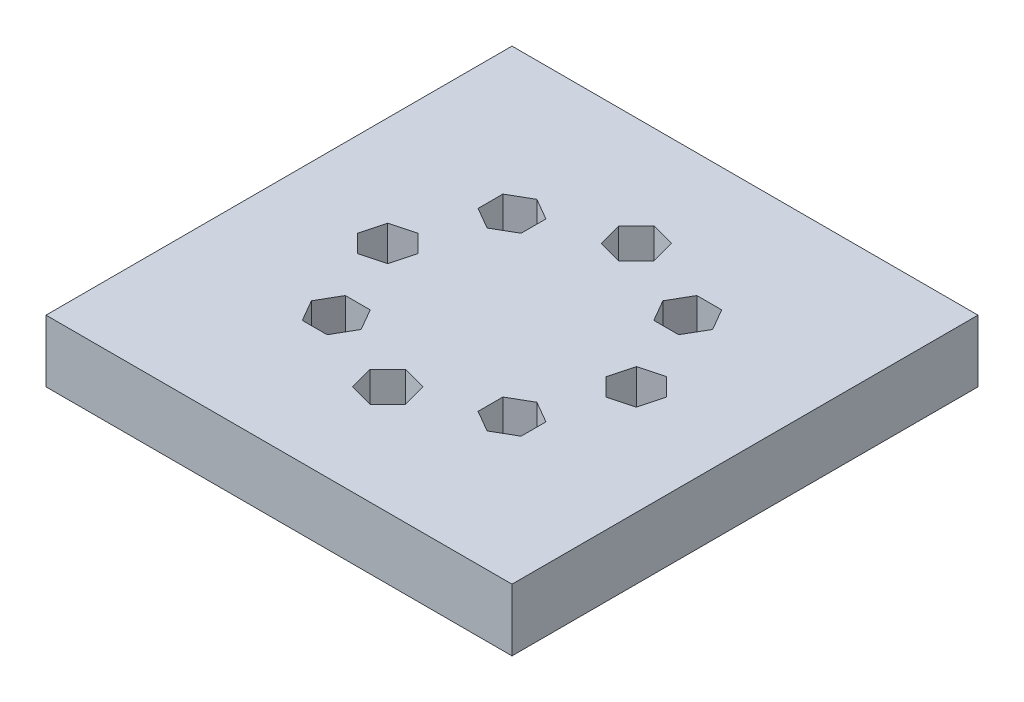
ISO-10303-21;
HEADER;
FILE_DESCRIPTION(('STEP AP214'),'2;1');
FILE_NAME('part.step','',(''),(''),'','','');
FILE_SCHEMA(('AUTOMOTIVE_DESIGN { 1 0 10303 214 1 1 1 1 }'));
ENDSEC;
DATA;
#1=APPLICATION_CONTEXT('core data for automotive mechanical design processes');
#2=APPLICATION_PROTOCOL_DEFINITION('international standard','automotive_design',2000,#1);
#3=PRODUCT_CONTEXT('',#1,'mechanical');
#4=PRODUCT('Part','Part','',(#3));
#5=PRODUCT_RELATED_PRODUCT_CATEGORY('part','',(#4));
#6=PRODUCT_DEFINITION_FORMATION('','',#4);
#7=PRODUCT_DEFINITION_CONTEXT('part definition',#1,'design');
#8=PRODUCT_DEFINITION('design','',#6,#7);
#9=PRODUCT_DEFINITION_SHAPE('','',#8);
#10=(LENGTH_UNIT() NAMED_UNIT(*) SI_UNIT(.MILLI.,.METRE.));
#11=(NAMED_UNIT(*) PLANE_ANGLE_UNIT() SI_UNIT($,.RADIAN.));
#12=(NAMED_UNIT(*) SI_UNIT($,.STERADIAN.) SOLID_ANGLE_UNIT());
#13=UNCERTAINTY_MEASURE_WITH_UNIT(LENGTH_MEASURE(1.E-05),#10,'distance_accuracy_value','');
#14=(GEOMETRIC_REPRESENTATION_CONTEXT(3) GLOBAL_UNCERTAINTY_ASSIGNED_CONTEXT((#13)) GLOBAL_UNIT_ASSIGNED_CONTEXT((#10,
#11,#12)) REPRESENTATION_CONTEXT('',''));
#15=CARTESIAN_POINT('',(0.,0.,0.));
#16=DIRECTION('',(0.,0.,1.));
#17=DIRECTION('',(1.,0.,0.));
#18=AXIS2_PLACEMENT_3D('',#15,#16,#17);
#19=CARTESIAN_POINT('',(-75.,20.,-75.));
#20=DIRECTION('',(1.,0.,0.));
#21=DIRECTION('',(0.,0.,-1.));
#22=AXIS2_PLACEMENT_3D('',#19,#20,#21);
#23=PLANE('',#22);
#24=DIRECTION('',(0.,0.,1.));
#25=VECTOR('',#24,1.);
#26=CARTESIAN_POINT('',(-75.,0.,-75.));
#27=LINE('',#26,#25);
#28=CARTESIAN_POINT('',(-75.,0.,-75.));
#29=VERTEX_POINT('',#28);
#30=CARTESIAN_POINT('',(-75.,0.,75.));
#31=VERTEX_POINT('',#30);
#32=EDGE_CURVE('E738',#29,#31,#27,.T.);
#33=ORIENTED_EDGE('',*,*,#32,.T.);
#34=DIRECTION('',(0.,-1.,0.));
#35=VECTOR('',#34,1.);
#36=CARTESIAN_POINT('',(-75.,20.,75.));
#37=LINE('',#36,#35);
#38=CARTESIAN_POINT('',(-75.,20.,75.));
#39=VERTEX_POINT('',#38);
#40=EDGE_CURVE('E11',#39,#31,#37,.T.);
#41=ORIENTED_EDGE('',*,*,#40,.F.);
#42=DIRECTION('',(0.,0.,1.));
#43=VECTOR('',#42,1.);
#44=CARTESIAN_POINT('',(-75.,20.,-75.));
#45=LINE('',#44,#43);
#46=CARTESIAN_POINT('',(-75.,20.,-75.));
#47=VERTEX_POINT('',#46);
#48=EDGE_CURVE('E757',#47,#39,#45,.T.);
#49=ORIENTED_EDGE('',*,*,#48,.F.);
#50=DIRECTION('',(0.,-1.,0.));
#51=VECTOR('',#50,1.);
#52=CARTESIAN_POINT('',(-75.,20.,-75.));
#53=LINE('',#52,#51);
#54=EDGE_CURVE('E766',#47,#29,#53,.T.);
#55=ORIENTED_EDGE('',*,*,#54,.T.);
#56=EDGE_LOOP('',(#33,#41,#49,#55));
#57=FACE_BOUND('',#56,.T.);
#58=ADVANCED_FACE('F32',(#57),#23,.F.);
#59=CARTESIAN_POINT('',(-75.,20.,75.));
#60=DIRECTION('',(0.,0.,-1.));
#61=DIRECTION('',(-1.,0.,0.));
#62=AXIS2_PLACEMENT_3D('',#59,#60,#61);
#63=PLANE('',#62);
#64=DIRECTION('',(1.,0.,0.));
#65=VECTOR('',#64,1.);
#66=CARTESIAN_POINT('',(-75.,0.,75.));
#67=LINE('',#66,#65);
#68=CARTESIAN_POINT('',(75.,0.,75.));
#69=VERTEX_POINT('',#68);
#70=EDGE_CURVE('E751',#31,#69,#67,.T.);
#71=ORIENTED_EDGE('',*,*,#70,.T.);
#72=DIRECTION('',(0.,-1.,0.));
#73=VECTOR('',#72,1.);
#74=CARTESIAN_POINT('',(75.,20.,75.));
#75=LINE('',#74,#73);
#76=CARTESIAN_POINT('',(75.,20.,75.));
#77=VERTEX_POINT('',#76);
#78=EDGE_CURVE('E39',#77,#69,#75,.T.);
#79=ORIENTED_EDGE('',*,*,#78,.F.);
#80=DIRECTION('',(1.,0.,0.));
#81=VECTOR('',#80,1.);
#82=CARTESIAN_POINT('',(-75.,20.,75.));
#83=LINE('',#82,#81);
#84=EDGE_CURVE('E760',#39,#77,#83,.T.);
#85=ORIENTED_EDGE('',*,*,#84,.F.);
#86=ORIENTED_EDGE('',*,*,#40,.T.);
#87=EDGE_LOOP('',(#71,#79,#85,#86));
#88=FACE_BOUND('',#87,.T.);
#89=ADVANCED_FACE('F791',(#88),#63,.F.);
#90=CARTESIAN_POINT('',(75.,20.,-75.));
#91=DIRECTION('',(-1.,0.,0.));
#92=DIRECTION('',(0.,0.,1.));
#93=AXIS2_PLACEMENT_3D('',#90,#91,#92);
#94=PLANE('',#93);
#95=DIRECTION('',(0.,0.,-1.));
#96=VECTOR('',#95,1.);
#97=CARTESIAN_POINT('',(75.,0.,-75.));
#98=LINE('',#97,#96);
#99=CARTESIAN_POINT('',(75.,0.,-75.));
#100=VERTEX_POINT('',#99);
#101=EDGE_CURVE('E753',#69,#100,#98,.T.);
#102=ORIENTED_EDGE('',*,*,#101,.T.);
#103=DIRECTION('',(0.,-1.,0.));
#104=VECTOR('',#103,1.);
#105=CARTESIAN_POINT('',(75.,20.,-75.));
#106=LINE('',#105,#104);
#107=CARTESIAN_POINT('',(75.,20.,-75.));
#108=VERTEX_POINT('',#107);
#109=EDGE_CURVE('E769',#108,#100,#106,.T.);
#110=ORIENTED_EDGE('',*,*,#109,.F.);
#111=DIRECTION('',(0.,0.,-1.));
#112=VECTOR('',#111,1.);
#113=CARTESIAN_POINT('',(75.,20.,-75.));
#114=LINE('',#113,#112);
#115=EDGE_CURVE('E762',#77,#108,#114,.T.);
#116=ORIENTED_EDGE('',*,*,#115,.F.);
#117=ORIENTED_EDGE('',*,*,#78,.T.);
#118=EDGE_LOOP('',(#102,#110,#116,#117));
#119=FACE_BOUND('',#118,.T.);
#120=ADVANCED_FACE('F776',(#119),#94,.F.);
#121=CARTESIAN_POINT('',(-75.,20.,-75.));
#122=DIRECTION('',(0.,0.,1.));
#123=DIRECTION('',(1.,0.,0.));
#124=AXIS2_PLACEMENT_3D('',#121,#122,#123);
#125=PLANE('',#124);
#126=DIRECTION('',(-1.,0.,0.));
#127=VECTOR('',#126,1.);
#128=CARTESIAN_POINT('',(-75.,0.,-75.));
#129=LINE('',#128,#127);
#130=EDGE_CURVE('E755',#100,#29,#129,.T.);
#131=ORIENTED_EDGE('',*,*,#130,.T.);
#132=ORIENTED_EDGE('',*,*,#54,.F.);
#133=DIRECTION('',(-1.,0.,0.));
#134=VECTOR('',#133,1.);
#135=CARTESIAN_POINT('',(-75.,20.,-75.));
#136=LINE('',#135,#134);
#137=EDGE_CURVE('E764',#108,#47,#136,.T.);
#138=ORIENTED_EDGE('',*,*,#137,.F.);
#139=ORIENTED_EDGE('',*,*,#109,.T.);
#140=EDGE_LOOP('',(#131,#132,#138,#139));
#141=FACE_BOUND('',#140,.T.);
#142=ADVANCED_FACE('F784',(#141),#125,.F.);
#143=CARTESIAN_POINT('',(-75.,20.,75.));
#144=DIRECTION('',(0.,1.,0.));
#145=DIRECTION('',(0.,0.,1.));
#146=AXIS2_PLACEMENT_3D('',#143,#144,#145);
#147=PLANE('',#146);
#148=DIRECTION('',(0.965925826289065,0.,-0.258819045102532));
#149=VECTOR('',#148,1.);
#150=CARTESIAN_POINT('',(37.9294476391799,20.,7.72740661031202));
#151=LINE('',#150,#149);
#152=CARTESIAN_POINT('',(37.9294476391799,20.,7.72740661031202));
#153=VERTEX_POINT('',#152);
#154=CARTESIAN_POINT('',(45.6568542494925,20.,5.65685424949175));
#155=VERTEX_POINT('',#154);
#156=EDGE_CURVE('E46',#153,#155,#151,.T.);
#157=ORIENTED_EDGE('',*,*,#156,.F.);
#158=DIRECTION('',(0.707106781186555,0.,0.70710678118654));
#159=VECTOR('',#158,1.);
#160=CARTESIAN_POINT('',(32.2725933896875,20.,2.07055236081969));
#161=LINE('',#160,#159);
#162=CARTESIAN_POINT('',(32.2725933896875,20.,2.07055236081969));
#163=VERTEX_POINT('',#162);
#164=EDGE_CURVE('E379',#163,#153,#161,.T.);
#165=ORIENTED_EDGE('',*,*,#164,.F.);
#166=DIRECTION('',(-0.258819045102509,0.,0.965925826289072));
#167=VECTOR('',#166,1.);
#168=CARTESIAN_POINT('',(34.3431457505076,20.,-5.65685424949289));
#169=LINE('',#168,#167);
#170=CARTESIAN_POINT('',(34.3431457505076,20.,-5.65685424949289));
#171=VERTEX_POINT('',#170);
#172=EDGE_CURVE('E382',#171,#163,#169,.T.);
#173=ORIENTED_EDGE('',*,*,#172,.F.);
#174=DIRECTION('',(-0.965925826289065,0.,0.258819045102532));
#175=VECTOR('',#174,1.);
#176=CARTESIAN_POINT('',(42.0705523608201,20.,-7.72740661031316));
#177=LINE('',#176,#175);
#178=CARTESIAN_POINT('',(42.0705523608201,20.,-7.72740661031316));
#179=VERTEX_POINT('',#178);
#180=EDGE_CURVE('E398',#179,#171,#177,.T.);
#181=ORIENTED_EDGE('',*,*,#180,.F.);
#182=DIRECTION('',(-0.707106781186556,0.,-0.707106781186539));
#183=VECTOR('',#182,1.);
#184=CARTESIAN_POINT('',(47.7274066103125,20.,-2.07055236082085));
#185=LINE('',#184,#183);
#186=CARTESIAN_POINT('',(47.7274066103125,20.,-2.07055236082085));
#187=VERTEX_POINT('',#186);
#188=EDGE_CURVE('E395',#187,#179,#185,.T.);
#189=ORIENTED_EDGE('',*,*,#188,.F.);
#190=DIRECTION('',(0.258819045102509,0.,-0.965925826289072));
#191=VECTOR('',#190,1.);
#192=CARTESIAN_POINT('',(45.6568542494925,20.,5.65685424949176));
#193=LINE('',#192,#191);
#194=EDGE_CURVE('E393',#155,#187,#193,.T.);
#195=ORIENTED_EDGE('',*,*,#194,.F.);
#196=EDGE_LOOP('',(#157,#165,#173,#181,#189,#195));
#197=FACE_BOUND('',#196,.T.);
#198=DIRECTION('',(0.866025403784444,0.,0.499999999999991));
#199=VECTOR('',#198,1.);
#200=CARTESIAN_POINT('',(21.3560680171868,20.,32.2842712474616));
#201=LINE('',#200,#199);
#202=CARTESIAN_POINT('',(21.3560680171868,20.,32.2842712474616));
#203=VERTEX_POINT('',#202);
#204=CARTESIAN_POINT('',(28.2842712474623,20.,36.2842712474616));
#205=VERTEX_POINT('',#204);
#206=EDGE_CURVE('E405',#203,#205,#201,.T.);
#207=ORIENTED_EDGE('',*,*,#206,.F.);
#208=DIRECTION('',(0.,0.,1.));
#209=VECTOR('',#208,1.);
#210=CARTESIAN_POINT('',(21.3560680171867,20.,24.2842712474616));
#211=LINE('',#210,#209);
#212=CARTESIAN_POINT('',(21.3560680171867,20.,24.2842712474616));
#213=VERTEX_POINT('',#212);
#214=EDGE_CURVE('E417',#213,#203,#211,.T.);
#215=ORIENTED_EDGE('',*,*,#214,.F.);
#216=DIRECTION('',(-0.866025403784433,0.,0.500000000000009));
#217=VECTOR('',#216,1.);
#218=CARTESIAN_POINT('',(28.2842712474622,20.,20.2842712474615));
#219=LINE('',#218,#217);
#220=CARTESIAN_POINT('',(28.2842712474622,20.,20.2842712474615));
#221=VERTEX_POINT('',#220);
#222=EDGE_CURVE('E443',#221,#213,#219,.T.);
#223=ORIENTED_EDGE('',*,*,#222,.F.);
#224=DIRECTION('',(-0.866025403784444,0.,-0.499999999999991));
#225=VECTOR('',#224,1.);
#226=CARTESIAN_POINT('',(35.2124744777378,20.,24.2842712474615));
#227=LINE('',#226,#225);
#228=CARTESIAN_POINT('',(35.2124744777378,20.,24.2842712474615));
#229=VERTEX_POINT('',#228);
#230=EDGE_CURVE('E440',#229,#221,#227,.T.);
#231=ORIENTED_EDGE('',*,*,#230,.F.);
#232=DIRECTION('',(0.,0.,-1.));
#233=VECTOR('',#232,1.);
#234=CARTESIAN_POINT('',(35.2124744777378,20.,32.2842712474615));
#235=LINE('',#234,#233);
#236=CARTESIAN_POINT('',(35.2124744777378,20.,32.2842712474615));
#237=VERTEX_POINT('',#236);
#238=EDGE_CURVE('E437',#237,#229,#235,.T.);
#239=ORIENTED_EDGE('',*,*,#238,.F.);
#240=DIRECTION('',(0.866025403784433,0.,-0.500000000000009));
#241=VECTOR('',#240,1.);
#242=CARTESIAN_POINT('',(28.2842712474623,20.,36.2842712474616));
#243=LINE('',#242,#241);
#244=EDGE_CURVE('E434',#205,#237,#243,.T.);
#245=ORIENTED_EDGE('',*,*,#244,.F.);
#246=EDGE_LOOP('',(#207,#215,#223,#231,#239,#245));
#247=FACE_BOUND('',#246,.T.);
#248=DIRECTION('',(0.258819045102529,0.,0.965925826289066));
#249=VECTOR('',#248,1.);
#250=CARTESIAN_POINT('',(-7.72740661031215,20.,37.9294476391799));
#251=LINE('',#250,#249);
#252=CARTESIAN_POINT('',(-7.72740661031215,20.,37.9294476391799));
#253=VERTEX_POINT('',#252);
#254=CARTESIAN_POINT('',(-5.6568542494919,20.,45.6568542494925));
#255=VERTEX_POINT('',#254);
#256=EDGE_CURVE('E450',#253,#255,#251,.T.);
#257=ORIENTED_EDGE('',*,*,#256,.F.);
#258=DIRECTION('',(-0.707106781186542,0.,0.707106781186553));
#259=VECTOR('',#258,1.);
#260=CARTESIAN_POINT('',(-2.0705523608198,20.,32.2725933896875));
#261=LINE('',#260,#259);
#262=CARTESIAN_POINT('',(-2.0705523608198,20.,32.2725933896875));
#263=VERTEX_POINT('',#262);
#264=EDGE_CURVE('E465',#263,#253,#261,.T.);
#265=ORIENTED_EDGE('',*,*,#264,.F.);
#266=DIRECTION('',(-0.965925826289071,0.,-0.258819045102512));
#267=VECTOR('',#266,1.);
#268=CARTESIAN_POINT('',(5.65685424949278,20.,34.3431457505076));
#269=LINE('',#268,#267);
#270=CARTESIAN_POINT('',(5.65685424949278,20.,34.3431457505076));
#271=VERTEX_POINT('',#270);
#272=EDGE_CURVE('E491',#271,#263,#269,.T.);
#273=ORIENTED_EDGE('',*,*,#272,.F.);
#274=DIRECTION('',(-0.258819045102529,0.,-0.965925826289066));
#275=VECTOR('',#274,1.);
#276=CARTESIAN_POINT('',(7.72740661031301,20.,42.0705523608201));
#277=LINE('',#276,#275);
#278=CARTESIAN_POINT('',(7.72740661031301,20.,42.0705523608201));
#279=VERTEX_POINT('',#278);
#280=EDGE_CURVE('E488',#279,#271,#277,.T.);
#281=ORIENTED_EDGE('',*,*,#280,.F.);
#282=DIRECTION('',(0.707106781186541,0.,-0.707106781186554));
#283=VECTOR('',#282,1.);
#284=CARTESIAN_POINT('',(2.07055236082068,20.,47.7274066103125));
#285=LINE('',#284,#283);
#286=CARTESIAN_POINT('',(2.07055236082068,20.,47.7274066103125));
#287=VERTEX_POINT('',#286);
#288=EDGE_CURVE('E485',#287,#279,#285,.T.);
#289=ORIENTED_EDGE('',*,*,#288,.F.);
#290=DIRECTION('',(0.965925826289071,0.,0.258819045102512));
#291=VECTOR('',#290,1.);
#292=CARTESIAN_POINT('',(-5.65685424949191,20.,45.6568542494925));
#293=LINE('',#292,#291);
#294=EDGE_CURVE('E482',#255,#287,#293,.T.);
#295=ORIENTED_EDGE('',*,*,#294,.F.);
#296=EDGE_LOOP('',(#257,#265,#273,#281,#289,#295));
#297=FACE_BOUND('',#296,.T.);
#298=DIRECTION('',(-0.5,0.,0.866025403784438));
#299=VECTOR('',#298,1.);
#300=CARTESIAN_POINT('',(-32.2842712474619,20.,21.3560680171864));
#301=LINE('',#300,#299);
#302=CARTESIAN_POINT('',(-32.2842712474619,20.,21.3560680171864));
#303=VERTEX_POINT('',#302);
#304=CARTESIAN_POINT('',(-36.2842712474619,20.,28.284271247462));
#305=VERTEX_POINT('',#304);
#306=EDGE_CURVE('E498',#303,#305,#301,.T.);
#307=ORIENTED_EDGE('',*,*,#306,.F.);
#308=DIRECTION('',(-1.,0.,0.));
#309=VECTOR('',#308,1.);
#310=CARTESIAN_POINT('',(-24.2842712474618,20.,21.3560680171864));
#311=LINE('',#310,#309);
#312=CARTESIAN_POINT('',(-24.2842712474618,20.,21.3560680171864));
#313=VERTEX_POINT('',#312);
#314=EDGE_CURVE('E513',#313,#303,#311,.T.);
#315=ORIENTED_EDGE('',*,*,#314,.F.);
#316=DIRECTION('',(-0.5,0.,-0.866025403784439));
#317=VECTOR('',#316,1.);
#318=CARTESIAN_POINT('',(-20.2842712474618,20.,28.284271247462));
#319=LINE('',#318,#317);
#320=CARTESIAN_POINT('',(-20.2842712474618,20.,28.284271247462));
#321=VERTEX_POINT('',#320);
#322=EDGE_CURVE('E539',#321,#313,#319,.T.);
#323=ORIENTED_EDGE('',*,*,#322,.F.);
#324=DIRECTION('',(0.5,0.,-0.866025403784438));
#325=VECTOR('',#324,1.);
#326=CARTESIAN_POINT('',(-24.2842712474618,20.,35.2124744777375));
#327=LINE('',#326,#325);
#328=CARTESIAN_POINT('',(-24.2842712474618,20.,35.2124744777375));
#329=VERTEX_POINT('',#328);
#330=EDGE_CURVE('E536',#329,#321,#327,.T.);
#331=ORIENTED_EDGE('',*,*,#330,.F.);
#332=DIRECTION('',(1.,0.,0.));
#333=VECTOR('',#332,1.);
#334=CARTESIAN_POINT('',(-32.2842712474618,20.,35.2124744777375));
#335=LINE('',#334,#333);
#336=CARTESIAN_POINT('',(-32.2842712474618,20.,35.2124744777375));
#337=VERTEX_POINT('',#336);
#338=EDGE_CURVE('E533',#337,#329,#335,.T.);
#339=ORIENTED_EDGE('',*,*,#338,.F.);
#340=DIRECTION('',(0.5,0.,0.866025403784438));
#341=VECTOR('',#340,1.);
#342=CARTESIAN_POINT('',(-36.2842712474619,20.,28.284271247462));
#343=LINE('',#342,#341);
#344=EDGE_CURVE('E530',#305,#337,#343,.T.);
#345=ORIENTED_EDGE('',*,*,#344,.F.);
#346=EDGE_LOOP('',(#307,#315,#323,#331,#339,#345));
#347=FACE_BOUND('',#346,.T.);
#348=DIRECTION('',(-0.965925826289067,0.,0.258819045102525));
#349=VECTOR('',#348,1.);
#350=CARTESIAN_POINT('',(-37.9294476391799,20.,-7.72740661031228));
#351=LINE('',#350,#349);
#352=CARTESIAN_POINT('',(-37.9294476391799,20.,-7.72740661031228));
#353=VERTEX_POINT('',#352);
#354=CARTESIAN_POINT('',(-45.6568542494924,20.,-5.65685424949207));
#355=VERTEX_POINT('',#354);
#356=EDGE_CURVE('E546',#353,#355,#351,.T.);
#357=ORIENTED_EDGE('',*,*,#356,.F.);
#358=DIRECTION('',(-0.707106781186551,0.,-0.707106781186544));
#359=VECTOR('',#358,1.);
#360=CARTESIAN_POINT('',(-32.2725933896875,20.,-2.07055236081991));
#361=LINE('',#360,#359);
#362=CARTESIAN_POINT('',(-32.2725933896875,20.,-2.07055236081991));
#363=VERTEX_POINT('',#362);
#364=EDGE_CURVE('E561',#363,#353,#361,.T.);
#365=ORIENTED_EDGE('',*,*,#364,.F.);
#366=DIRECTION('',(0.258819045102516,0.,-0.96592582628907));
#367=VECTOR('',#366,1.);
#368=CARTESIAN_POINT('',(-34.3431457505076,20.,5.65685424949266));
#369=LINE('',#368,#367);
#370=CARTESIAN_POINT('',(-34.3431457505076,20.,5.65685424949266));
#371=VERTEX_POINT('',#370);
#372=EDGE_CURVE('E587',#371,#363,#369,.T.);
#373=ORIENTED_EDGE('',*,*,#372,.F.);
#374=DIRECTION('',(0.965925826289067,0.,-0.258819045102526));
#375=VECTOR('',#374,1.);
#376=CARTESIAN_POINT('',(-42.0705523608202,20.,7.72740661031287));
#377=LINE('',#376,#375);
#378=CARTESIAN_POINT('',(-42.0705523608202,20.,7.72740661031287));
#379=VERTEX_POINT('',#378);
#380=EDGE_CURVE('E584',#379,#371,#377,.T.);
#381=ORIENTED_EDGE('',*,*,#380,.F.);
#382=DIRECTION('',(0.707106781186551,0.,0.707106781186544));
#383=VECTOR('',#382,1.);
#384=CARTESIAN_POINT('',(-47.7274066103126,20.,2.07055236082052));
#385=LINE('',#384,#383);
#386=CARTESIAN_POINT('',(-47.7274066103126,20.,2.07055236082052));
#387=VERTEX_POINT('',#386);
#388=EDGE_CURVE('E581',#387,#379,#385,.T.);
#389=ORIENTED_EDGE('',*,*,#388,.F.);
#390=DIRECTION('',(-0.258819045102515,0.,0.96592582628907));
#391=VECTOR('',#390,1.);
#392=CARTESIAN_POINT('',(-45.6568542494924,20.,-5.65685424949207));
#393=LINE('',#392,#391);
#394=EDGE_CURVE('E578',#355,#387,#393,.T.);
#395=ORIENTED_EDGE('',*,*,#394,.F.);
#396=EDGE_LOOP('',(#357,#365,#373,#381,#389,#395));
#397=FACE_BOUND('',#396,.T.);
#398=DIRECTION('',(-0.86602540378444,0.,-0.499999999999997));
#399=VECTOR('',#398,1.);
#400=CARTESIAN_POINT('',(-21.3560680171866,20.,-32.2842712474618));
#401=LINE('',#400,#399);
#402=CARTESIAN_POINT('',(-21.3560680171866,20.,-32.2842712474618));
#403=VERTEX_POINT('',#402);
#404=CARTESIAN_POINT('',(-28.2842712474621,20.,-36.2842712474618));
#405=VERTEX_POINT('',#404);
#406=EDGE_CURVE('E594',#403,#405,#401,.T.);
#407=ORIENTED_EDGE('',*,*,#406,.F.);
#408=DIRECTION('',(0.,0.,-1.));
#409=VECTOR('',#408,1.);
#410=CARTESIAN_POINT('',(-21.3560680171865,20.,-24.2842712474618));
#411=LINE('',#410,#409);
#412=CARTESIAN_POINT('',(-21.3560680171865,20.,-24.2842712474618));
#413=VERTEX_POINT('',#412);
#414=EDGE_CURVE('E609',#413,#403,#411,.T.);
#415=ORIENTED_EDGE('',*,*,#414,.F.);
#416=DIRECTION('',(0.866025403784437,0.,-0.500000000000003));
#417=VECTOR('',#416,1.);
#418=CARTESIAN_POINT('',(-28.284271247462,20.,-20.2842712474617));
#419=LINE('',#418,#417);
#420=CARTESIAN_POINT('',(-28.284271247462,20.,-20.2842712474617));
#421=VERTEX_POINT('',#420);
#422=EDGE_CURVE('E635',#421,#413,#419,.T.);
#423=ORIENTED_EDGE('',*,*,#422,.F.);
#424=DIRECTION('',(0.86602540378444,0.,0.499999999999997));
#425=VECTOR('',#424,1.);
#426=CARTESIAN_POINT('',(-35.2124744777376,20.,-24.2842712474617));
#427=LINE('',#426,#425);
#428=CARTESIAN_POINT('',(-35.2124744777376,20.,-24.2842712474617));
#429=VERTEX_POINT('',#428);
#430=EDGE_CURVE('E632',#429,#421,#427,.T.);
#431=ORIENTED_EDGE('',*,*,#430,.F.);
#432=DIRECTION('',(0.,0.,1.));
#433=VECTOR('',#432,1.);
#434=CARTESIAN_POINT('',(-35.2124744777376,20.,-32.2842712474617));
#435=LINE('',#434,#433);
#436=CARTESIAN_POINT('',(-35.2124744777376,20.,-32.2842712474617));
#437=VERTEX_POINT('',#436);
#438=EDGE_CURVE('E629',#437,#429,#435,.T.);
#439=ORIENTED_EDGE('',*,*,#438,.F.);
#440=DIRECTION('',(-0.866025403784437,0.,0.500000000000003));
#441=VECTOR('',#440,1.);
#442=CARTESIAN_POINT('',(-28.2842712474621,20.,-36.2842712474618));
#443=LINE('',#442,#441);
#444=EDGE_CURVE('E626',#405,#437,#443,.T.);
#445=ORIENTED_EDGE('',*,*,#444,.F.);
#446=EDGE_LOOP('',(#407,#415,#423,#431,#439,#445));
#447=FACE_BOUND('',#446,.T.);
#448=DIRECTION('',(-0.258819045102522,0.,-0.965925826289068));
#449=VECTOR('',#448,1.);
#450=CARTESIAN_POINT('',(7.72740661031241,20.,-37.9294476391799));
#451=LINE('',#450,#449);
#452=CARTESIAN_POINT('',(7.72740661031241,20.,-37.9294476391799));
#453=VERTEX_POINT('',#452);
#454=CARTESIAN_POINT('',(5.65685424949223,20.,-45.6568542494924));
#455=VERTEX_POINT('',#454);
#456=EDGE_CURVE('E642',#453,#455,#451,.T.);
#457=ORIENTED_EDGE('',*,*,#456,.F.);
#458=DIRECTION('',(0.707106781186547,0.,-0.707106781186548));
#459=VECTOR('',#458,1.);
#460=CARTESIAN_POINT('',(2.07055236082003,20.,-32.2725933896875));
#461=LINE('',#460,#459);
#462=CARTESIAN_POINT('',(2.07055236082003,20.,-32.2725933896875));
#463=VERTEX_POINT('',#462);
#464=EDGE_CURVE('E657',#463,#453,#461,.T.);
#465=ORIENTED_EDGE('',*,*,#464,.F.);
#466=DIRECTION('',(0.965925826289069,0.,0.258819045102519));
#467=VECTOR('',#466,1.);
#468=CARTESIAN_POINT('',(-5.65685424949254,20.,-34.3431457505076));
#469=LINE('',#468,#467);
#470=CARTESIAN_POINT('',(-5.65685424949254,20.,-34.3431457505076));
#471=VERTEX_POINT('',#470);
#472=EDGE_CURVE('E683',#471,#463,#469,.T.);
#473=ORIENTED_EDGE('',*,*,#472,.F.);
#474=DIRECTION('',(0.258819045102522,0.,0.965925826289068));
#475=VECTOR('',#474,1.);
#476=CARTESIAN_POINT('',(-7.72740661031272,20.,-42.0705523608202));
#477=LINE('',#476,#475);
#478=CARTESIAN_POINT('',(-7.72740661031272,20.,-42.0705523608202));
#479=VERTEX_POINT('',#478);
#480=EDGE_CURVE('E680',#479,#471,#477,.T.);
#481=ORIENTED_EDGE('',*,*,#480,.F.);
#482=DIRECTION('',(-0.707106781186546,0.,0.707106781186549));
#483=VECTOR('',#482,1.);
#484=CARTESIAN_POINT('',(-2.07055236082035,20.,-47.7274066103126));
#485=LINE('',#484,#483);
#486=CARTESIAN_POINT('',(-2.07055236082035,20.,-47.7274066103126));
#487=VERTEX_POINT('',#486);
#488=EDGE_CURVE('E677',#487,#479,#485,.T.);
#489=ORIENTED_EDGE('',*,*,#488,.F.);
#490=DIRECTION('',(-0.965925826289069,0.,-0.258819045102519));
#491=VECTOR('',#490,1.);
#492=CARTESIAN_POINT('',(5.65685424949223,20.,-45.6568542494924));
#493=LINE('',#492,#491);
#494=EDGE_CURVE('E674',#455,#487,#493,.T.);
#495=ORIENTED_EDGE('',*,*,#494,.F.);
#496=EDGE_LOOP('',(#457,#465,#473,#481,#489,#495));
#497=FACE_BOUND('',#496,.T.);
#498=DIRECTION('',(0.5,0.,-0.866025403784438));
#499=VECTOR('',#498,1.);
#500=CARTESIAN_POINT('',(32.2842712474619,20.,-21.3560680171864));
#501=LINE('',#500,#499);
#502=CARTESIAN_POINT('',(32.2842712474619,20.,-21.3560680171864));
#503=VERTEX_POINT('',#502);
#504=CARTESIAN_POINT('',(36.2842712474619,20.,-28.284271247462));
#505=VERTEX_POINT('',#504);
#506=EDGE_CURVE('E690',#503,#505,#501,.T.);
#507=ORIENTED_EDGE('',*,*,#506,.F.);
#508=DIRECTION('',(1.,0.,0.));
#509=VECTOR('',#508,1.);
#510=CARTESIAN_POINT('',(24.2842712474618,20.,-21.3560680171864));
#511=LINE('',#510,#509);
#512=CARTESIAN_POINT('',(24.2842712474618,20.,-21.3560680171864));
#513=VERTEX_POINT('',#512);
#514=EDGE_CURVE('E714',#513,#503,#511,.T.);
#515=ORIENTED_EDGE('',*,*,#514,.F.);
#516=DIRECTION('',(0.5,0.,0.866025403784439));
#517=VECTOR('',#516,1.);
#518=CARTESIAN_POINT('',(20.2842712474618,20.,-28.284271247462));
#519=LINE('',#518,#517);
#520=CARTESIAN_POINT('',(20.2842712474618,20.,-28.284271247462));
#521=VERTEX_POINT('',#520);
#522=EDGE_CURVE('E711',#521,#513,#519,.T.);
#523=ORIENTED_EDGE('',*,*,#522,.F.);
#524=DIRECTION('',(-0.5,0.,0.866025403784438));
#525=VECTOR('',#524,1.);
#526=CARTESIAN_POINT('',(24.2842712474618,20.,-35.2124744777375));
#527=LINE('',#526,#525);
#528=CARTESIAN_POINT('',(24.2842712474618,20.,-35.2124744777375));
#529=VERTEX_POINT('',#528);
#530=EDGE_CURVE('E708',#529,#521,#527,.T.);
#531=ORIENTED_EDGE('',*,*,#530,.F.);
#532=DIRECTION('',(-1.,0.,0.));
#533=VECTOR('',#532,1.);
#534=CARTESIAN_POINT('',(32.2842712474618,20.,-35.2124744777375));
#535=LINE('',#534,#533);
#536=CARTESIAN_POINT('',(32.2842712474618,20.,-35.2124744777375));
#537=VERTEX_POINT('',#536);
#538=EDGE_CURVE('E705',#537,#529,#535,.T.);
#539=ORIENTED_EDGE('',*,*,#538,.F.);
#540=DIRECTION('',(-0.5,0.,-0.866025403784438));
#541=VECTOR('',#540,1.);
#542=CARTESIAN_POINT('',(36.2842712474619,20.,-28.284271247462));
#543=LINE('',#542,#541);
#544=EDGE_CURVE('E702',#505,#537,#543,.T.);
#545=ORIENTED_EDGE('',*,*,#544,.F.);
#546=EDGE_LOOP('',(#507,#515,#523,#531,#539,#545));
#547=FACE_BOUND('',#546,.T.);
#548=ORIENTED_EDGE('',*,*,#48,.T.);
#549=ORIENTED_EDGE('',*,*,#84,.T.);
#550=ORIENTED_EDGE('',*,*,#115,.T.);
#551=ORIENTED_EDGE('',*,*,#137,.T.);
#552=EDGE_LOOP('',(#548,#549,#550,#551));
#553=FACE_BOUND('',#552,.T.);
#554=ADVANCED_FACE('F790',(#197,#247,#297,#347,#397,#447,#497,#547,#553),#147,.T.);
#555=CARTESIAN_POINT('',(-75.,0.,75.));
#556=DIRECTION('',(0.,1.,0.));
#557=DIRECTION('',(0.,0.,1.));
#558=AXIS2_PLACEMENT_3D('',#555,#556,#557);
#559=PLANE('',#558);
#560=DIRECTION('',(0.707106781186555,0.,0.70710678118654));
#561=VECTOR('',#560,1.);
#562=CARTESIAN_POINT('',(32.2725933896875,0.,2.07055236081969));
#563=LINE('',#562,#561);
#564=CARTESIAN_POINT('',(32.2725933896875,0.,2.07055236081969));
#565=VERTEX_POINT('',#564);
#566=CARTESIAN_POINT('',(37.9294476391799,0.,7.72740661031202));
#567=VERTEX_POINT('',#566);
#568=EDGE_CURVE('E368',#565,#567,#563,.T.);
#569=ORIENTED_EDGE('',*,*,#568,.T.);
#570=DIRECTION('',(0.965925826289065,0.,-0.258819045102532));
#571=VECTOR('',#570,1.);
#572=CARTESIAN_POINT('',(37.9294476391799,0.,7.72740661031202));
#573=LINE('',#572,#571);
#574=CARTESIAN_POINT('',(45.6568542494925,0.,5.65685424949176));
#575=VERTEX_POINT('',#574);
#576=EDGE_CURVE('E362',#567,#575,#573,.T.);
#577=ORIENTED_EDGE('',*,*,#576,.T.);
#578=DIRECTION('',(0.258819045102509,0.,-0.965925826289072));
#579=VECTOR('',#578,1.);
#580=CARTESIAN_POINT('',(45.6568542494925,0.,5.65685424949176));
#581=LINE('',#580,#579);
#582=CARTESIAN_POINT('',(47.7274066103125,0.,-2.07055236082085));
#583=VERTEX_POINT('',#582);
#584=EDGE_CURVE('E371',#575,#583,#581,.T.);
#585=ORIENTED_EDGE('',*,*,#584,.T.);
#586=DIRECTION('',(-0.707106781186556,0.,-0.707106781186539));
#587=VECTOR('',#586,1.);
#588=CARTESIAN_POINT('',(47.7274066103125,0.,-2.07055236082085));
#589=LINE('',#588,#587);
#590=CARTESIAN_POINT('',(42.0705523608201,0.,-7.72740661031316));
#591=VERTEX_POINT('',#590);
#592=EDGE_CURVE('E54',#583,#591,#589,.T.);
#593=ORIENTED_EDGE('',*,*,#592,.T.);
#594=DIRECTION('',(-0.965925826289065,0.,0.258819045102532));
#595=VECTOR('',#594,1.);
#596=CARTESIAN_POINT('',(42.0705523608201,0.,-7.72740661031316));
#597=LINE('',#596,#595);
#598=CARTESIAN_POINT('',(34.3431457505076,0.,-5.65685424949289));
#599=VERTEX_POINT('',#598);
#600=EDGE_CURVE('E386',#591,#599,#597,.T.);
#601=ORIENTED_EDGE('',*,*,#600,.T.);
#602=DIRECTION('',(-0.258819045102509,0.,0.965925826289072));
#603=VECTOR('',#602,1.);
#604=CARTESIAN_POINT('',(34.3431457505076,0.,-5.65685424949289));
#605=LINE('',#604,#603);
#606=EDGE_CURVE('E389',#599,#565,#605,.T.);
#607=ORIENTED_EDGE('',*,*,#606,.T.);
#608=EDGE_LOOP('',(#569,#577,#585,#593,#601,#607));
#609=FACE_BOUND('',#608,.T.);
#610=DIRECTION('',(0.,0.,1.));
#611=VECTOR('',#610,1.);
#612=CARTESIAN_POINT('',(21.3560680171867,0.,24.2842712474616));
#613=LINE('',#612,#611);
#614=CARTESIAN_POINT('',(21.3560680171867,0.,24.2842712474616));
#615=VERTEX_POINT('',#614);
#616=CARTESIAN_POINT('',(21.3560680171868,0.,32.2842712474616));
#617=VERTEX_POINT('',#616);
#618=EDGE_CURVE('E429',#615,#617,#613,.T.);
#619=ORIENTED_EDGE('',*,*,#618,.T.);
#620=DIRECTION('',(0.866025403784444,0.,0.499999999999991));
#621=VECTOR('',#620,1.);
#622=CARTESIAN_POINT('',(21.3560680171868,0.,32.2842712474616));
#623=LINE('',#622,#621);
#624=CARTESIAN_POINT('',(28.2842712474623,0.,36.2842712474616));
#625=VERTEX_POINT('',#624);
#626=EDGE_CURVE('E413',#617,#625,#623,.T.);
#627=ORIENTED_EDGE('',*,*,#626,.T.);
#628=DIRECTION('',(0.866025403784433,0.,-0.500000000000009));
#629=VECTOR('',#628,1.);
#630=CARTESIAN_POINT('',(28.2842712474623,0.,36.2842712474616));
#631=LINE('',#630,#629);
#632=CARTESIAN_POINT('',(35.2124744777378,0.,32.2842712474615));
#633=VERTEX_POINT('',#632);
#634=EDGE_CURVE('E416',#625,#633,#631,.T.);
#635=ORIENTED_EDGE('',*,*,#634,.T.);
#636=DIRECTION('',(0.,0.,-1.));
#637=VECTOR('',#636,1.);
#638=CARTESIAN_POINT('',(35.2124744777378,0.,32.2842712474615));
#639=LINE('',#638,#637);
#640=CARTESIAN_POINT('',(35.2124744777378,0.,24.2842712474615));
#641=VERTEX_POINT('',#640);
#642=EDGE_CURVE('E420',#633,#641,#639,.T.);
#643=ORIENTED_EDGE('',*,*,#642,.T.);
#644=DIRECTION('',(-0.866025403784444,0.,-0.499999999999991));
#645=VECTOR('',#644,1.);
#646=CARTESIAN_POINT('',(35.2124744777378,0.,24.2842712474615));
#647=LINE('',#646,#645);
#648=CARTESIAN_POINT('',(28.2842712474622,0.,20.2842712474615));
#649=VERTEX_POINT('',#648);
#650=EDGE_CURVE('E423',#641,#649,#647,.T.);
#651=ORIENTED_EDGE('',*,*,#650,.T.);
#652=DIRECTION('',(-0.866025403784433,0.,0.500000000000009));
#653=VECTOR('',#652,1.);
#654=CARTESIAN_POINT('',(28.2842712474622,0.,20.2842712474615));
#655=LINE('',#654,#653);
#656=EDGE_CURVE('E426',#649,#615,#655,.T.);
#657=ORIENTED_EDGE('',*,*,#656,.T.);
#658=EDGE_LOOP('',(#619,#627,#635,#643,#651,#657));
#659=FACE_BOUND('',#658,.T.);
#660=DIRECTION('',(-0.707106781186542,0.,0.707106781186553));
#661=VECTOR('',#660,1.);
#662=CARTESIAN_POINT('',(-2.0705523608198,0.,32.2725933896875));
#663=LINE('',#662,#661);
#664=CARTESIAN_POINT('',(-2.0705523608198,0.,32.2725933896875));
#665=VERTEX_POINT('',#664);
#666=CARTESIAN_POINT('',(-7.72740661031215,0.,37.9294476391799));
#667=VERTEX_POINT('',#666);
#668=EDGE_CURVE('E477',#665,#667,#663,.T.);
#669=ORIENTED_EDGE('',*,*,#668,.T.);
#670=DIRECTION('',(0.258819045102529,0.,0.965925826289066));
#671=VECTOR('',#670,1.);
#672=CARTESIAN_POINT('',(-7.72740661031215,0.,37.9294476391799));
#673=LINE('',#672,#671);
#674=CARTESIAN_POINT('',(-5.65685424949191,0.,45.6568542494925));
#675=VERTEX_POINT('',#674);
#676=EDGE_CURVE('E461',#667,#675,#673,.T.);
#677=ORIENTED_EDGE('',*,*,#676,.T.);
#678=DIRECTION('',(0.965925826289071,0.,0.258819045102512));
#679=VECTOR('',#678,1.);
#680=CARTESIAN_POINT('',(-5.65685424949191,0.,45.6568542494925));
#681=LINE('',#680,#679);
#682=CARTESIAN_POINT('',(2.07055236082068,0.,47.7274066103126));
#683=VERTEX_POINT('',#682);
#684=EDGE_CURVE('E464',#675,#683,#681,.T.);
#685=ORIENTED_EDGE('',*,*,#684,.T.);
#686=DIRECTION('',(0.707106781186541,0.,-0.707106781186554));
#687=VECTOR('',#686,1.);
#688=CARTESIAN_POINT('',(2.07055236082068,0.,47.7274066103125));
#689=LINE('',#688,#687);
#690=CARTESIAN_POINT('',(7.72740661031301,0.,42.0705523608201));
#691=VERTEX_POINT('',#690);
#692=EDGE_CURVE('E468',#683,#691,#689,.T.);
#693=ORIENTED_EDGE('',*,*,#692,.T.);
#694=DIRECTION('',(-0.258819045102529,0.,-0.965925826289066));
#695=VECTOR('',#694,1.);
#696=CARTESIAN_POINT('',(7.72740661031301,0.,42.0705523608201));
#697=LINE('',#696,#695);
#698=CARTESIAN_POINT('',(5.65685424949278,0.,34.3431457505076));
#699=VERTEX_POINT('',#698);
#700=EDGE_CURVE('E471',#691,#699,#697,.T.);
#701=ORIENTED_EDGE('',*,*,#700,.T.);
#702=DIRECTION('',(-0.965925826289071,0.,-0.258819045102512));
#703=VECTOR('',#702,1.);
#704=CARTESIAN_POINT('',(5.65685424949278,0.,34.3431457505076));
#705=LINE('',#704,#703);
#706=EDGE_CURVE('E474',#699,#665,#705,.T.);
#707=ORIENTED_EDGE('',*,*,#706,.T.);
#708=EDGE_LOOP('',(#669,#677,#685,#693,#701,#707));
#709=FACE_BOUND('',#708,.T.);
#710=DIRECTION('',(-1.,0.,0.));
#711=VECTOR('',#710,1.);
#712=CARTESIAN_POINT('',(-24.2842712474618,0.,21.3560680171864));
#713=LINE('',#712,#711);
#714=CARTESIAN_POINT('',(-24.2842712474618,0.,21.3560680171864));
#715=VERTEX_POINT('',#714);
#716=CARTESIAN_POINT('',(-32.2842712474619,0.,21.3560680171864));
#717=VERTEX_POINT('',#716);
#718=EDGE_CURVE('E525',#715,#717,#713,.T.);
#719=ORIENTED_EDGE('',*,*,#718,.T.);
#720=DIRECTION('',(-0.5,0.,0.866025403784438));
#721=VECTOR('',#720,1.);
#722=CARTESIAN_POINT('',(-32.2842712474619,0.,21.3560680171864));
#723=LINE('',#722,#721);
#724=CARTESIAN_POINT('',(-36.2842712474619,0.,28.284271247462));
#725=VERTEX_POINT('',#724);
#726=EDGE_CURVE('E509',#717,#725,#723,.T.);
#727=ORIENTED_EDGE('',*,*,#726,.T.);
#728=DIRECTION('',(0.5,0.,0.866025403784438));
#729=VECTOR('',#728,1.);
#730=CARTESIAN_POINT('',(-36.2842712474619,0.,28.284271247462));
#731=LINE('',#730,#729);
#732=CARTESIAN_POINT('',(-32.2842712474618,0.,35.2124744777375));
#733=VERTEX_POINT('',#732);
#734=EDGE_CURVE('E512',#725,#733,#731,.T.);
#735=ORIENTED_EDGE('',*,*,#734,.T.);
#736=DIRECTION('',(1.,0.,0.));
#737=VECTOR('',#736,1.);
#738=CARTESIAN_POINT('',(-32.2842712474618,0.,35.2124744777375));
#739=LINE('',#738,#737);
#740=CARTESIAN_POINT('',(-24.2842712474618,0.,35.2124744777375));
#741=VERTEX_POINT('',#740);
#742=EDGE_CURVE('E516',#733,#741,#739,.T.);
#743=ORIENTED_EDGE('',*,*,#742,.T.);
#744=DIRECTION('',(0.5,0.,-0.866025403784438));
#745=VECTOR('',#744,1.);
#746=CARTESIAN_POINT('',(-24.2842712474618,0.,35.2124744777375));
#747=LINE('',#746,#745);
#748=CARTESIAN_POINT('',(-20.2842712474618,0.,28.284271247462));
#749=VERTEX_POINT('',#748);
#750=EDGE_CURVE('E519',#741,#749,#747,.T.);
#751=ORIENTED_EDGE('',*,*,#750,.T.);
#752=DIRECTION('',(-0.5,0.,-0.866025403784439));
#753=VECTOR('',#752,1.);
#754=CARTESIAN_POINT('',(-20.2842712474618,0.,28.284271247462));
#755=LINE('',#754,#753);
#756=EDGE_CURVE('E522',#749,#715,#755,.T.);
#757=ORIENTED_EDGE('',*,*,#756,.T.);
#758=EDGE_LOOP('',(#719,#727,#735,#743,#751,#757));
#759=FACE_BOUND('',#758,.T.);
#760=DIRECTION('',(-0.707106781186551,0.,-0.707106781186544));
#761=VECTOR('',#760,1.);
#762=CARTESIAN_POINT('',(-32.2725933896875,0.,-2.07055236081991));
#763=LINE('',#762,#761);
#764=CARTESIAN_POINT('',(-32.2725933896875,0.,-2.07055236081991));
#765=VERTEX_POINT('',#764);
#766=CARTESIAN_POINT('',(-37.9294476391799,0.,-7.72740661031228));
#767=VERTEX_POINT('',#766);
#768=EDGE_CURVE('E573',#765,#767,#763,.T.);
#769=ORIENTED_EDGE('',*,*,#768,.T.);
#770=DIRECTION('',(-0.965925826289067,0.,0.258819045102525));
#771=VECTOR('',#770,1.);
#772=CARTESIAN_POINT('',(-37.9294476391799,0.,-7.72740661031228));
#773=LINE('',#772,#771);
#774=CARTESIAN_POINT('',(-45.6568542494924,0.,-5.65685424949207));
#775=VERTEX_POINT('',#774);
#776=EDGE_CURVE('E557',#767,#775,#773,.T.);
#777=ORIENTED_EDGE('',*,*,#776,.T.);
#778=DIRECTION('',(-0.258819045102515,0.,0.96592582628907));
#779=VECTOR('',#778,1.);
#780=CARTESIAN_POINT('',(-45.6568542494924,0.,-5.65685424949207));
#781=LINE('',#780,#779);
#782=CARTESIAN_POINT('',(-47.7274066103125,0.,2.07055236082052));
#783=VERTEX_POINT('',#782);
#784=EDGE_CURVE('E560',#775,#783,#781,.T.);
#785=ORIENTED_EDGE('',*,*,#784,.T.);
#786=DIRECTION('',(0.707106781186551,0.,0.707106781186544));
#787=VECTOR('',#786,1.);
#788=CARTESIAN_POINT('',(-47.7274066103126,0.,2.07055236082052));
#789=LINE('',#788,#787);
#790=CARTESIAN_POINT('',(-42.0705523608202,0.,7.72740661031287));
#791=VERTEX_POINT('',#790);
#792=EDGE_CURVE('E564',#783,#791,#789,.T.);
#793=ORIENTED_EDGE('',*,*,#792,.T.);
#794=DIRECTION('',(0.965925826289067,0.,-0.258819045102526));
#795=VECTOR('',#794,1.);
#796=CARTESIAN_POINT('',(-42.0705523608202,0.,7.72740661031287));
#797=LINE('',#796,#795);
#798=CARTESIAN_POINT('',(-34.3431457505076,0.,5.65685424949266));
#799=VERTEX_POINT('',#798);
#800=EDGE_CURVE('E567',#791,#799,#797,.T.);
#801=ORIENTED_EDGE('',*,*,#800,.T.);
#802=DIRECTION('',(0.258819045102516,0.,-0.96592582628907));
#803=VECTOR('',#802,1.);
#804=CARTESIAN_POINT('',(-34.3431457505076,0.,5.65685424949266));
#805=LINE('',#804,#803);
#806=EDGE_CURVE('E570',#799,#765,#805,.T.);
#807=ORIENTED_EDGE('',*,*,#806,.T.);
#808=EDGE_LOOP('',(#769,#777,#785,#793,#801,#807));
#809=FACE_BOUND('',#808,.T.);
#810=DIRECTION('',(0.,0.,-1.));
#811=VECTOR('',#810,1.);
#812=CARTESIAN_POINT('',(-21.3560680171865,0.,-24.2842712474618));
#813=LINE('',#812,#811);
#814=CARTESIAN_POINT('',(-21.3560680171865,0.,-24.2842712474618));
#815=VERTEX_POINT('',#814);
#816=CARTESIAN_POINT('',(-21.3560680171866,0.,-32.2842712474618));
#817=VERTEX_POINT('',#816);
#818=EDGE_CURVE('E621',#815,#817,#813,.T.);
#819=ORIENTED_EDGE('',*,*,#818,.T.);
#820=DIRECTION('',(-0.86602540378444,0.,-0.499999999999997));
#821=VECTOR('',#820,1.);
#822=CARTESIAN_POINT('',(-21.3560680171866,0.,-32.2842712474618));
#823=LINE('',#822,#821);
#824=CARTESIAN_POINT('',(-28.2842712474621,0.,-36.2842712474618));
#825=VERTEX_POINT('',#824);
#826=EDGE_CURVE('E605',#817,#825,#823,.T.);
#827=ORIENTED_EDGE('',*,*,#826,.T.);
#828=DIRECTION('',(-0.866025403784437,0.,0.500000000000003));
#829=VECTOR('',#828,1.);
#830=CARTESIAN_POINT('',(-28.2842712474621,0.,-36.2842712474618));
#831=LINE('',#830,#829);
#832=CARTESIAN_POINT('',(-35.2124744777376,0.,-32.2842712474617));
#833=VERTEX_POINT('',#832);
#834=EDGE_CURVE('E608',#825,#833,#831,.T.);
#835=ORIENTED_EDGE('',*,*,#834,.T.);
#836=DIRECTION('',(0.,0.,1.));
#837=VECTOR('',#836,1.);
#838=CARTESIAN_POINT('',(-35.2124744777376,0.,-32.2842712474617));
#839=LINE('',#838,#837);
#840=CARTESIAN_POINT('',(-35.2124744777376,0.,-24.2842712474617));
#841=VERTEX_POINT('',#840);
#842=EDGE_CURVE('E612',#833,#841,#839,.T.);
#843=ORIENTED_EDGE('',*,*,#842,.T.);
#844=DIRECTION('',(0.86602540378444,0.,0.499999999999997));
#845=VECTOR('',#844,1.);
#846=CARTESIAN_POINT('',(-35.2124744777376,0.,-24.2842712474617));
#847=LINE('',#846,#845);
#848=CARTESIAN_POINT('',(-28.284271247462,0.,-20.2842712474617));
#849=VERTEX_POINT('',#848);
#850=EDGE_CURVE('E615',#841,#849,#847,.T.);
#851=ORIENTED_EDGE('',*,*,#850,.T.);
#852=DIRECTION('',(0.866025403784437,0.,-0.500000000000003));
#853=VECTOR('',#852,1.);
#854=CARTESIAN_POINT('',(-28.284271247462,0.,-20.2842712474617));
#855=LINE('',#854,#853);
#856=EDGE_CURVE('E618',#849,#815,#855,.T.);
#857=ORIENTED_EDGE('',*,*,#856,.T.);
#858=EDGE_LOOP('',(#819,#827,#835,#843,#851,#857));
#859=FACE_BOUND('',#858,.T.);
#860=DIRECTION('',(0.707106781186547,0.,-0.707106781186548));
#861=VECTOR('',#860,1.);
#862=CARTESIAN_POINT('',(2.07055236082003,0.,-32.2725933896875));
#863=LINE('',#862,#861);
#864=CARTESIAN_POINT('',(2.07055236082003,0.,-32.2725933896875));
#865=VERTEX_POINT('',#864);
#866=CARTESIAN_POINT('',(7.72740661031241,0.,-37.9294476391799));
#867=VERTEX_POINT('',#866);
#868=EDGE_CURVE('E669',#865,#867,#863,.T.);
#869=ORIENTED_EDGE('',*,*,#868,.T.);
#870=DIRECTION('',(-0.258819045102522,0.,-0.965925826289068));
#871=VECTOR('',#870,1.);
#872=CARTESIAN_POINT('',(7.72740661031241,0.,-37.9294476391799));
#873=LINE('',#872,#871);
#874=CARTESIAN_POINT('',(5.65685424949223,0.,-45.6568542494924));
#875=VERTEX_POINT('',#874);
#876=EDGE_CURVE('E653',#867,#875,#873,.T.);
#877=ORIENTED_EDGE('',*,*,#876,.T.);
#878=DIRECTION('',(-0.965925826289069,0.,-0.258819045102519));
#879=VECTOR('',#878,1.);
#880=CARTESIAN_POINT('',(5.65685424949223,0.,-45.6568542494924));
#881=LINE('',#880,#879);
#882=CARTESIAN_POINT('',(-2.07055236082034,0.,-47.7274066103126));
#883=VERTEX_POINT('',#882);
#884=EDGE_CURVE('E656',#875,#883,#881,.T.);
#885=ORIENTED_EDGE('',*,*,#884,.T.);
#886=DIRECTION('',(-0.707106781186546,0.,0.707106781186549));
#887=VECTOR('',#886,1.);
#888=CARTESIAN_POINT('',(-2.07055236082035,0.,-47.7274066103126));
#889=LINE('',#888,#887);
#890=CARTESIAN_POINT('',(-7.72740661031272,0.,-42.0705523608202));
#891=VERTEX_POINT('',#890);
#892=EDGE_CURVE('E660',#883,#891,#889,.T.);
#893=ORIENTED_EDGE('',*,*,#892,.T.);
#894=DIRECTION('',(0.258819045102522,0.,0.965925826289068));
#895=VECTOR('',#894,1.);
#896=CARTESIAN_POINT('',(-7.72740661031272,0.,-42.0705523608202));
#897=LINE('',#896,#895);
#898=CARTESIAN_POINT('',(-5.65685424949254,0.,-34.3431457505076));
#899=VERTEX_POINT('',#898);
#900=EDGE_CURVE('E663',#891,#899,#897,.T.);
#901=ORIENTED_EDGE('',*,*,#900,.T.);
#902=DIRECTION('',(0.965925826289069,0.,0.258819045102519));
#903=VECTOR('',#902,1.);
#904=CARTESIAN_POINT('',(-5.65685424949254,0.,-34.3431457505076));
#905=LINE('',#904,#903);
#906=EDGE_CURVE('E666',#899,#865,#905,.T.);
#907=ORIENTED_EDGE('',*,*,#906,.T.);
#908=EDGE_LOOP('',(#869,#877,#885,#893,#901,#907));
#909=FACE_BOUND('',#908,.T.);
#910=DIRECTION('',(1.,0.,0.));
#911=VECTOR('',#910,1.);
#912=CARTESIAN_POINT('',(24.2842712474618,0.,-21.3560680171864));
#913=LINE('',#912,#911);
#914=CARTESIAN_POINT('',(24.2842712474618,0.,-21.3560680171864));
#915=VERTEX_POINT('',#914);
#916=CARTESIAN_POINT('',(32.2842712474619,0.,-21.3560680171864));
#917=VERTEX_POINT('',#916);
#918=EDGE_CURVE('E732',#915,#917,#913,.T.);
#919=ORIENTED_EDGE('',*,*,#918,.T.);
#920=DIRECTION('',(0.5,0.,-0.866025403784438));
#921=VECTOR('',#920,1.);
#922=CARTESIAN_POINT('',(32.2842712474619,0.,-21.3560680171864));
#923=LINE('',#922,#921);
#924=CARTESIAN_POINT('',(36.2842712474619,0.,-28.284271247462));
#925=VERTEX_POINT('',#924);
#926=EDGE_CURVE('E717',#917,#925,#923,.T.);
#927=ORIENTED_EDGE('',*,*,#926,.T.);
#928=DIRECTION('',(-0.5,0.,-0.866025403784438));
#929=VECTOR('',#928,1.);
#930=CARTESIAN_POINT('',(36.2842712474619,0.,-28.284271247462));
#931=LINE('',#930,#929);
#932=CARTESIAN_POINT('',(32.2842712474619,0.,-35.2124744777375));
#933=VERTEX_POINT('',#932);
#934=EDGE_CURVE('E720',#925,#933,#931,.T.);
#935=ORIENTED_EDGE('',*,*,#934,.T.);
#936=DIRECTION('',(-1.,0.,0.));
#937=VECTOR('',#936,1.);
#938=CARTESIAN_POINT('',(32.2842712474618,0.,-35.2124744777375));
#939=LINE('',#938,#937);
#940=CARTESIAN_POINT('',(24.2842712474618,0.,-35.2124744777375));
#941=VERTEX_POINT('',#940);
#942=EDGE_CURVE('E723',#933,#941,#939,.T.);
#943=ORIENTED_EDGE('',*,*,#942,.T.);
#944=DIRECTION('',(-0.5,0.,0.866025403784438));
#945=VECTOR('',#944,1.);
#946=CARTESIAN_POINT('',(24.2842712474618,0.,-35.2124744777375));
#947=LINE('',#946,#945);
#948=CARTESIAN_POINT('',(20.2842712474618,0.,-28.284271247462));
#949=VERTEX_POINT('',#948);
#950=EDGE_CURVE('E726',#941,#949,#947,.T.);
#951=ORIENTED_EDGE('',*,*,#950,.T.);
#952=DIRECTION('',(0.5,0.,0.866025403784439));
#953=VECTOR('',#952,1.);
#954=CARTESIAN_POINT('',(20.2842712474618,0.,-28.284271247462));
#955=LINE('',#954,#953);
#956=EDGE_CURVE('E729',#949,#915,#955,.T.);
#957=ORIENTED_EDGE('',*,*,#956,.T.);
#958=EDGE_LOOP('',(#919,#927,#935,#943,#951,#957));
#959=FACE_BOUND('',#958,.T.);
#960=ORIENTED_EDGE('',*,*,#32,.F.);
#961=ORIENTED_EDGE('',*,*,#130,.F.);
#962=ORIENTED_EDGE('',*,*,#101,.F.);
#963=ORIENTED_EDGE('',*,*,#70,.F.);
#964=EDGE_LOOP('',(#960,#961,#962,#963));
#965=FACE_BOUND('',#964,.T.);
#966=ADVANCED_FACE('F375',(#609,#659,#709,#759,#809,#859,#909,#959,#965),#559,.F.);
#967=CARTESIAN_POINT('',(32.2842712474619,0.,-21.3560680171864));
#968=DIRECTION('',(0.866025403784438,0.,0.5));
#969=DIRECTION('',(0.5,0.,-0.866025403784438));
#970=AXIS2_PLACEMENT_3D('',#967,#968,#969);
#971=PLANE('',#970);
#972=ORIENTED_EDGE('',*,*,#506,.T.);
#973=DIRECTION('',(0.,1.,0.));
#974=VECTOR('',#973,1.);
#975=CARTESIAN_POINT('',(36.2842712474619,0.,-28.284271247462));
#976=LINE('',#975,#974);
#977=EDGE_CURVE('E735',#925,#505,#976,.T.);
#978=ORIENTED_EDGE('',*,*,#977,.F.);
#979=ORIENTED_EDGE('',*,*,#926,.F.);
#980=DIRECTION('',(0.,1.,0.));
#981=VECTOR('',#980,1.);
#982=CARTESIAN_POINT('',(32.2842712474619,0.,-21.3560680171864));
#983=LINE('',#982,#981);
#984=EDGE_CURVE('E736',#917,#503,#983,.T.);
#985=ORIENTED_EDGE('',*,*,#984,.T.);
#986=EDGE_LOOP('',(#972,#978,#979,#985));
#987=FACE_BOUND('',#986,.T.);
#988=ADVANCED_FACE('F806',(#987),#971,.F.);
#989=CARTESIAN_POINT('',(24.2842712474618,0.,-21.3560680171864));
#990=DIRECTION('',(0.,0.,1.));
#991=DIRECTION('',(1.,0.,0.));
#992=AXIS2_PLACEMENT_3D('',#989,#990,#991);
#993=PLANE('',#992);
#994=ORIENTED_EDGE('',*,*,#514,.T.);
#995=ORIENTED_EDGE('',*,*,#984,.F.);
#996=ORIENTED_EDGE('',*,*,#918,.F.);
#997=DIRECTION('',(0.,1.,0.));
#998=VECTOR('',#997,1.);
#999=CARTESIAN_POINT('',(24.2842712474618,0.,-21.3560680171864));
#1000=LINE('',#999,#998);
#1001=EDGE_CURVE('E739',#915,#513,#1000,.T.);
#1002=ORIENTED_EDGE('',*,*,#1001,.T.);
#1003=EDGE_LOOP('',(#994,#995,#996,#1002));
#1004=FACE_BOUND('',#1003,.T.);
#1005=ADVANCED_FACE('F809',(#1004),#993,.F.);
#1006=CARTESIAN_POINT('',(20.2842712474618,0.,-28.284271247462));
#1007=DIRECTION('',(-0.866025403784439,0.,0.5));
#1008=DIRECTION('',(0.5,0.,0.866025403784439));
#1009=AXIS2_PLACEMENT_3D('',#1006,#1007,#1008);
#1010=PLANE('',#1009);
#1011=ORIENTED_EDGE('',*,*,#522,.T.);
#1012=ORIENTED_EDGE('',*,*,#1001,.F.);
#1013=ORIENTED_EDGE('',*,*,#956,.F.);
#1014=DIRECTION('',(0.,1.,0.));
#1015=VECTOR('',#1014,1.);
#1016=CARTESIAN_POINT('',(20.2842712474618,0.,-28.284271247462));
#1017=LINE('',#1016,#1015);
#1018=EDGE_CURVE('E741',#949,#521,#1017,.T.);
#1019=ORIENTED_EDGE('',*,*,#1018,.T.);
#1020=EDGE_LOOP('',(#1011,#1012,#1013,#1019));
#1021=FACE_BOUND('',#1020,.T.);
#1022=ADVANCED_FACE('F823',(#1021),#1010,.F.);
#1023=CARTESIAN_POINT('',(24.2842712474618,0.,-35.2124744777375));
#1024=DIRECTION('',(-0.866025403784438,0.,-0.5));
#1025=DIRECTION('',(-0.5,0.,0.866025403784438));
#1026=AXIS2_PLACEMENT_3D('',#1023,#1024,#1025);
#1027=PLANE('',#1026);
#1028=ORIENTED_EDGE('',*,*,#530,.T.);
#1029=ORIENTED_EDGE('',*,*,#1018,.F.);
#1030=ORIENTED_EDGE('',*,*,#950,.F.);
#1031=DIRECTION('',(0.,1.,0.));
#1032=VECTOR('',#1031,1.);
#1033=CARTESIAN_POINT('',(24.2842712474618,0.,-35.2124744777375));
#1034=LINE('',#1033,#1032);
#1035=EDGE_CURVE('E743',#941,#529,#1034,.T.);
#1036=ORIENTED_EDGE('',*,*,#1035,.T.);
#1037=EDGE_LOOP('',(#1028,#1029,#1030,#1036));
#1038=FACE_BOUND('',#1037,.T.);
#1039=ADVANCED_FACE('F819',(#1038),#1027,.F.);
#1040=CARTESIAN_POINT('',(32.2842712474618,0.,-35.2124744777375));
#1041=DIRECTION('',(0.,0.,-1.));
#1042=DIRECTION('',(0.,1.,0.));
#1043=AXIS2_PLACEMENT_3D('',#1040,#1041,#1042);
#1044=PLANE('',#1043);
#1045=ORIENTED_EDGE('',*,*,#538,.T.);
#1046=ORIENTED_EDGE('',*,*,#1035,.F.);
#1047=ORIENTED_EDGE('',*,*,#942,.F.);
#1048=DIRECTION('',(0.,1.,0.));
#1049=VECTOR('',#1048,1.);
#1050=CARTESIAN_POINT('',(32.2842712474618,0.,-35.2124744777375));
#1051=LINE('',#1050,#1049);
#1052=EDGE_CURVE('E745',#933,#537,#1051,.T.);
#1053=ORIENTED_EDGE('',*,*,#1052,.T.);
#1054=EDGE_LOOP('',(#1045,#1046,#1047,#1053));
#1055=FACE_BOUND('',#1054,.T.);
#1056=ADVANCED_FACE('F815',(#1055),#1044,.F.);
#1057=CARTESIAN_POINT('',(36.2842712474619,0.,-28.284271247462));
#1058=DIRECTION('',(0.866025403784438,0.,-0.5));
#1059=DIRECTION('',(-0.5,0.,-0.866025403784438));
#1060=AXIS2_PLACEMENT_3D('',#1057,#1058,#1059);
#1061=PLANE('',#1060);
#1062=ORIENTED_EDGE('',*,*,#544,.T.);
#1063=ORIENTED_EDGE('',*,*,#1052,.F.);
#1064=ORIENTED_EDGE('',*,*,#934,.F.);
#1065=ORIENTED_EDGE('',*,*,#977,.T.);
#1066=EDGE_LOOP('',(#1062,#1063,#1064,#1065));
#1067=FACE_BOUND('',#1066,.T.);
#1068=ADVANCED_FACE('F811',(#1067),#1061,.F.);
#1069=CARTESIAN_POINT('',(7.72740661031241,0.,-37.9294476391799));
#1070=DIRECTION('',(0.965925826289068,0.,-0.258819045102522));
#1071=DIRECTION('',(-0.258819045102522,0.,-0.965925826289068));
#1072=AXIS2_PLACEMENT_3D('',#1069,#1070,#1071);
#1073=PLANE('',#1072);
#1074=ORIENTED_EDGE('',*,*,#456,.T.);
#1075=DIRECTION('',(0.,1.,0.));
#1076=VECTOR('',#1075,1.);
#1077=CARTESIAN_POINT('',(5.65685424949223,0.,-45.6568542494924));
#1078=LINE('',#1077,#1076);
#1079=EDGE_CURVE('E672',#875,#455,#1078,.T.);
#1080=ORIENTED_EDGE('',*,*,#1079,.F.);
#1081=ORIENTED_EDGE('',*,*,#876,.F.);
#1082=DIRECTION('',(0.,1.,0.));
#1083=VECTOR('',#1082,1.);
#1084=CARTESIAN_POINT('',(7.72740661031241,0.,-37.9294476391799));
#1085=LINE('',#1084,#1083);
#1086=EDGE_CURVE('E688',#867,#453,#1085,.T.);
#1087=ORIENTED_EDGE('',*,*,#1086,.T.);
#1088=EDGE_LOOP('',(#1074,#1080,#1081,#1087));
#1089=FACE_BOUND('',#1088,.T.);
#1090=ADVANCED_FACE('F814',(#1089),#1073,.F.);
#1091=CARTESIAN_POINT('',(2.07055236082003,0.,-32.2725933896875));
#1092=DIRECTION('',(0.707106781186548,0.,0.707106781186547));
#1093=DIRECTION('',(0.707106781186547,0.,-0.707106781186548));
#1094=AXIS2_PLACEMENT_3D('',#1091,#1092,#1093);
#1095=PLANE('',#1094);
#1096=ORIENTED_EDGE('',*,*,#464,.T.);
#1097=ORIENTED_EDGE('',*,*,#1086,.F.);
#1098=ORIENTED_EDGE('',*,*,#868,.F.);
#1099=DIRECTION('',(0.,1.,0.));
#1100=VECTOR('',#1099,1.);
#1101=CARTESIAN_POINT('',(2.07055236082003,0.,-32.2725933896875));
#1102=LINE('',#1101,#1100);
#1103=EDGE_CURVE('E691',#865,#463,#1102,.T.);
#1104=ORIENTED_EDGE('',*,*,#1103,.T.);
#1105=EDGE_LOOP('',(#1096,#1097,#1098,#1104));
#1106=FACE_BOUND('',#1105,.T.);
#1107=ADVANCED_FACE('F833',(#1106),#1095,.F.);
#1108=CARTESIAN_POINT('',(-5.65685424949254,0.,-34.3431457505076));
#1109=DIRECTION('',(-0.258819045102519,0.,0.965925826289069));
#1110=DIRECTION('',(0.965925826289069,0.,0.258819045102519));
#1111=AXIS2_PLACEMENT_3D('',#1108,#1109,#1110);
#1112=PLANE('',#1111);
#1113=ORIENTED_EDGE('',*,*,#472,.T.);
#1114=ORIENTED_EDGE('',*,*,#1103,.F.);
#1115=ORIENTED_EDGE('',*,*,#906,.F.);
#1116=DIRECTION('',(0.,1.,0.));
#1117=VECTOR('',#1116,1.);
#1118=CARTESIAN_POINT('',(-5.65685424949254,0.,-34.3431457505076));
#1119=LINE('',#1118,#1117);
#1120=EDGE_CURVE('E693',#899,#471,#1119,.T.);
#1121=ORIENTED_EDGE('',*,*,#1120,.T.);
#1122=EDGE_LOOP('',(#1113,#1114,#1115,#1121));
#1123=FACE_BOUND('',#1122,.T.);
#1124=ADVANCED_FACE('F847',(#1123),#1112,.F.);
#1125=CARTESIAN_POINT('',(-7.72740661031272,0.,-42.0705523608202));
#1126=DIRECTION('',(-0.965925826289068,0.,0.258819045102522));
#1127=DIRECTION('',(0.258819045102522,0.,0.965925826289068));
#1128=AXIS2_PLACEMENT_3D('',#1125,#1126,#1127);
#1129=PLANE('',#1128);
#1130=ORIENTED_EDGE('',*,*,#480,.T.);
#1131=ORIENTED_EDGE('',*,*,#1120,.F.);
#1132=ORIENTED_EDGE('',*,*,#900,.F.);
#1133=DIRECTION('',(0.,1.,0.));
#1134=VECTOR('',#1133,1.);
#1135=CARTESIAN_POINT('',(-7.72740661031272,0.,-42.0705523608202));
#1136=LINE('',#1135,#1134);
#1137=EDGE_CURVE('E695',#891,#479,#1136,.T.);
#1138=ORIENTED_EDGE('',*,*,#1137,.T.);
#1139=EDGE_LOOP('',(#1130,#1131,#1132,#1138));
#1140=FACE_BOUND('',#1139,.T.);
#1141=ADVANCED_FACE('F843',(#1140),#1129,.F.);
#1142=CARTESIAN_POINT('',(-2.07055236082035,0.,-47.7274066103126));
#1143=DIRECTION('',(-0.707106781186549,0.,-0.707106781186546));
#1144=DIRECTION('',(-0.707106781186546,0.,0.707106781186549));
#1145=AXIS2_PLACEMENT_3D('',#1142,#1143,#1144);
#1146=PLANE('',#1145);
#1147=ORIENTED_EDGE('',*,*,#488,.T.);
#1148=ORIENTED_EDGE('',*,*,#1137,.F.);
#1149=ORIENTED_EDGE('',*,*,#892,.F.);
#1150=DIRECTION('',(0.,1.,0.));
#1151=VECTOR('',#1150,1.);
#1152=CARTESIAN_POINT('',(-2.07055236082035,0.,-47.7274066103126));
#1153=LINE('',#1152,#1151);
#1154=EDGE_CURVE('E697',#883,#487,#1153,.T.);
#1155=ORIENTED_EDGE('',*,*,#1154,.T.);
#1156=EDGE_LOOP('',(#1147,#1148,#1149,#1155));
#1157=FACE_BOUND('',#1156,.T.);
#1158=ADVANCED_FACE('F839',(#1157),#1146,.F.);
#1159=CARTESIAN_POINT('',(5.65685424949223,0.,-45.6568542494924));
#1160=DIRECTION('',(0.258819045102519,0.,-0.965925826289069));
#1161=DIRECTION('',(-0.965925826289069,0.,-0.258819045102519));
#1162=AXIS2_PLACEMENT_3D('',#1159,#1160,#1161);
#1163=PLANE('',#1162);
#1164=ORIENTED_EDGE('',*,*,#494,.T.);
#1165=ORIENTED_EDGE('',*,*,#1154,.F.);
#1166=ORIENTED_EDGE('',*,*,#884,.F.);
#1167=ORIENTED_EDGE('',*,*,#1079,.T.);
#1168=EDGE_LOOP('',(#1164,#1165,#1166,#1167));
#1169=FACE_BOUND('',#1168,.T.);
#1170=ADVANCED_FACE('F835',(#1169),#1163,.F.);
#1171=CARTESIAN_POINT('',(-21.3560680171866,0.,-32.2842712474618));
#1172=DIRECTION('',(0.499999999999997,0.,-0.86602540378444));
#1173=DIRECTION('',(-0.86602540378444,0.,-0.499999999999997));
#1174=AXIS2_PLACEMENT_3D('',#1171,#1172,#1173);
#1175=PLANE('',#1174);
#1176=ORIENTED_EDGE('',*,*,#406,.T.);
#1177=DIRECTION('',(0.,1.,0.));
#1178=VECTOR('',#1177,1.);
#1179=CARTESIAN_POINT('',(-28.2842712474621,0.,-36.2842712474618));
#1180=LINE('',#1179,#1178);
#1181=EDGE_CURVE('E624',#825,#405,#1180,.T.);
#1182=ORIENTED_EDGE('',*,*,#1181,.F.);
#1183=ORIENTED_EDGE('',*,*,#826,.F.);
#1184=DIRECTION('',(0.,1.,0.));
#1185=VECTOR('',#1184,1.);
#1186=CARTESIAN_POINT('',(-21.3560680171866,0.,-32.2842712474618));
#1187=LINE('',#1186,#1185);
#1188=EDGE_CURVE('E640',#817,#403,#1187,.T.);
#1189=ORIENTED_EDGE('',*,*,#1188,.T.);
#1190=EDGE_LOOP('',(#1176,#1182,#1183,#1189));
#1191=FACE_BOUND('',#1190,.T.);
#1192=ADVANCED_FACE('F838',(#1191),#1175,.F.);
#1193=CARTESIAN_POINT('',(-21.3560680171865,0.,-24.2842712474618));
#1194=DIRECTION('',(1.,0.,0.));
#1195=DIRECTION('',(0.,0.,-1.));
#1196=AXIS2_PLACEMENT_3D('',#1193,#1194,#1195);
#1197=PLANE('',#1196);
#1198=ORIENTED_EDGE('',*,*,#414,.T.);
#1199=ORIENTED_EDGE('',*,*,#1188,.F.);
#1200=ORIENTED_EDGE('',*,*,#818,.F.);
#1201=DIRECTION('',(0.,1.,0.));
#1202=VECTOR('',#1201,1.);
#1203=CARTESIAN_POINT('',(-21.3560680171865,0.,-24.2842712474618));
#1204=LINE('',#1203,#1202);
#1205=EDGE_CURVE('E643',#815,#413,#1204,.T.);
#1206=ORIENTED_EDGE('',*,*,#1205,.T.);
#1207=EDGE_LOOP('',(#1198,#1199,#1200,#1206));
#1208=FACE_BOUND('',#1207,.T.);
#1209=ADVANCED_FACE('F857',(#1208),#1197,.F.);
#1210=CARTESIAN_POINT('',(-28.284271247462,0.,-20.2842712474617));
#1211=DIRECTION('',(0.500000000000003,0.,0.866025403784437));
#1212=DIRECTION('',(0.866025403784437,0.,-0.500000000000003));
#1213=AXIS2_PLACEMENT_3D('',#1210,#1211,#1212);
#1214=PLANE('',#1213);
#1215=ORIENTED_EDGE('',*,*,#422,.T.);
#1216=ORIENTED_EDGE('',*,*,#1205,.F.);
#1217=ORIENTED_EDGE('',*,*,#856,.F.);
#1218=DIRECTION('',(0.,1.,0.));
#1219=VECTOR('',#1218,1.);
#1220=CARTESIAN_POINT('',(-28.284271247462,0.,-20.2842712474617));
#1221=LINE('',#1220,#1219);
#1222=EDGE_CURVE('E645',#849,#421,#1221,.T.);
#1223=ORIENTED_EDGE('',*,*,#1222,.T.);
#1224=EDGE_LOOP('',(#1215,#1216,#1217,#1223));
#1225=FACE_BOUND('',#1224,.T.);
#1226=ADVANCED_FACE('F871',(#1225),#1214,.F.);
#1227=CARTESIAN_POINT('',(-35.2124744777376,0.,-24.2842712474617));
#1228=DIRECTION('',(-0.499999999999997,0.,0.86602540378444));
#1229=DIRECTION('',(0.86602540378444,0.,0.499999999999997));
#1230=AXIS2_PLACEMENT_3D('',#1227,#1228,#1229);
#1231=PLANE('',#1230);
#1232=ORIENTED_EDGE('',*,*,#430,.T.);
#1233=ORIENTED_EDGE('',*,*,#1222,.F.);
#1234=ORIENTED_EDGE('',*,*,#850,.F.);
#1235=DIRECTION('',(0.,1.,0.));
#1236=VECTOR('',#1235,1.);
#1237=CARTESIAN_POINT('',(-35.2124744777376,0.,-24.2842712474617));
#1238=LINE('',#1237,#1236);
#1239=EDGE_CURVE('E647',#841,#429,#1238,.T.);
#1240=ORIENTED_EDGE('',*,*,#1239,.T.);
#1241=EDGE_LOOP('',(#1232,#1233,#1234,#1240));
#1242=FACE_BOUND('',#1241,.T.);
#1243=ADVANCED_FACE('F867',(#1242),#1231,.F.);
#1244=CARTESIAN_POINT('',(-35.2124744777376,0.,-32.2842712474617));
#1245=DIRECTION('',(-1.,0.,0.));
#1246=DIRECTION('',(0.,0.,1.));
#1247=AXIS2_PLACEMENT_3D('',#1244,#1245,#1246);
#1248=PLANE('',#1247);
#1249=ORIENTED_EDGE('',*,*,#438,.T.);
#1250=ORIENTED_EDGE('',*,*,#1239,.F.);
#1251=ORIENTED_EDGE('',*,*,#842,.F.);
#1252=DIRECTION('',(0.,1.,0.));
#1253=VECTOR('',#1252,1.);
#1254=CARTESIAN_POINT('',(-35.2124744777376,0.,-32.2842712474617));
#1255=LINE('',#1254,#1253);
#1256=EDGE_CURVE('E649',#833,#437,#1255,.T.);
#1257=ORIENTED_EDGE('',*,*,#1256,.T.);
#1258=EDGE_LOOP('',(#1249,#1250,#1251,#1257));
#1259=FACE_BOUND('',#1258,.T.);
#1260=ADVANCED_FACE('F863',(#1259),#1248,.F.);
#1261=CARTESIAN_POINT('',(-28.2842712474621,0.,-36.2842712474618));
#1262=DIRECTION('',(-0.500000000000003,0.,-0.866025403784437));
#1263=DIRECTION('',(-0.866025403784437,0.,0.500000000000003));
#1264=AXIS2_PLACEMENT_3D('',#1261,#1262,#1263);
#1265=PLANE('',#1264);
#1266=ORIENTED_EDGE('',*,*,#444,.T.);
#1267=ORIENTED_EDGE('',*,*,#1256,.F.);
#1268=ORIENTED_EDGE('',*,*,#834,.F.);
#1269=ORIENTED_EDGE('',*,*,#1181,.T.);
#1270=EDGE_LOOP('',(#1266,#1267,#1268,#1269));
#1271=FACE_BOUND('',#1270,.T.);
#1272=ADVANCED_FACE('F859',(#1271),#1265,.F.);
#1273=CARTESIAN_POINT('',(-37.9294476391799,0.,-7.72740661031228));
#1274=DIRECTION('',(-0.258819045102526,0.,-0.965925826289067));
#1275=DIRECTION('',(-0.965925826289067,0.,0.258819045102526));
#1276=AXIS2_PLACEMENT_3D('',#1273,#1274,#1275);
#1277=PLANE('',#1276);
#1278=ORIENTED_EDGE('',*,*,#356,.T.);
#1279=DIRECTION('',(0.,1.,0.));
#1280=VECTOR('',#1279,1.);
#1281=CARTESIAN_POINT('',(-45.6568542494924,0.,-5.65685424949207));
#1282=LINE('',#1281,#1280);
#1283=EDGE_CURVE('E576',#775,#355,#1282,.T.);
#1284=ORIENTED_EDGE('',*,*,#1283,.F.);
#1285=ORIENTED_EDGE('',*,*,#776,.F.);
#1286=DIRECTION('',(0.,1.,0.));
#1287=VECTOR('',#1286,1.);
#1288=CARTESIAN_POINT('',(-37.9294476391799,0.,-7.72740661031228));
#1289=LINE('',#1288,#1287);
#1290=EDGE_CURVE('E592',#767,#353,#1289,.T.);
#1291=ORIENTED_EDGE('',*,*,#1290,.T.);
#1292=EDGE_LOOP('',(#1278,#1284,#1285,#1291));
#1293=FACE_BOUND('',#1292,.T.);
#1294=ADVANCED_FACE('F862',(#1293),#1277,.F.);
#1295=CARTESIAN_POINT('',(-32.2725933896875,0.,-2.07055236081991));
#1296=DIRECTION('',(0.707106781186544,0.,-0.707106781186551));
#1297=DIRECTION('',(-0.707106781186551,0.,-0.707106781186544));
#1298=AXIS2_PLACEMENT_3D('',#1295,#1296,#1297);
#1299=PLANE('',#1298);
#1300=ORIENTED_EDGE('',*,*,#364,.T.);
#1301=ORIENTED_EDGE('',*,*,#1290,.F.);
#1302=ORIENTED_EDGE('',*,*,#768,.F.);
#1303=DIRECTION('',(0.,1.,0.));
#1304=VECTOR('',#1303,1.);
#1305=CARTESIAN_POINT('',(-32.2725933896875,0.,-2.07055236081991));
#1306=LINE('',#1305,#1304);
#1307=EDGE_CURVE('E595',#765,#363,#1306,.T.);
#1308=ORIENTED_EDGE('',*,*,#1307,.T.);
#1309=EDGE_LOOP('',(#1300,#1301,#1302,#1308));
#1310=FACE_BOUND('',#1309,.T.);
#1311=ADVANCED_FACE('F881',(#1310),#1299,.F.);
#1312=CARTESIAN_POINT('',(-34.3431457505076,0.,5.65685424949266));
#1313=DIRECTION('',(0.96592582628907,0.,0.258819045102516));
#1314=DIRECTION('',(0.258819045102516,0.,-0.96592582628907));
#1315=AXIS2_PLACEMENT_3D('',#1312,#1313,#1314);
#1316=PLANE('',#1315);
#1317=ORIENTED_EDGE('',*,*,#372,.T.);
#1318=ORIENTED_EDGE('',*,*,#1307,.F.);
#1319=ORIENTED_EDGE('',*,*,#806,.F.);
#1320=DIRECTION('',(0.,1.,0.));
#1321=VECTOR('',#1320,1.);
#1322=CARTESIAN_POINT('',(-34.3431457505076,0.,5.65685424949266));
#1323=LINE('',#1322,#1321);
#1324=EDGE_CURVE('E597',#799,#371,#1323,.T.);
#1325=ORIENTED_EDGE('',*,*,#1324,.T.);
#1326=EDGE_LOOP('',(#1317,#1318,#1319,#1325));
#1327=FACE_BOUND('',#1326,.T.);
#1328=ADVANCED_FACE('F895',(#1327),#1316,.F.);
#1329=CARTESIAN_POINT('',(-42.0705523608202,0.,7.72740661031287));
#1330=DIRECTION('',(0.258819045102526,0.,0.965925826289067));
#1331=DIRECTION('',(0.965925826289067,0.,-0.258819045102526));
#1332=AXIS2_PLACEMENT_3D('',#1329,#1330,#1331);
#1333=PLANE('',#1332);
#1334=ORIENTED_EDGE('',*,*,#380,.T.);
#1335=ORIENTED_EDGE('',*,*,#1324,.F.);
#1336=ORIENTED_EDGE('',*,*,#800,.F.);
#1337=DIRECTION('',(0.,1.,0.));
#1338=VECTOR('',#1337,1.);
#1339=CARTESIAN_POINT('',(-42.0705523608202,0.,7.72740661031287));
#1340=LINE('',#1339,#1338);
#1341=EDGE_CURVE('E599',#791,#379,#1340,.T.);
#1342=ORIENTED_EDGE('',*,*,#1341,.T.);
#1343=EDGE_LOOP('',(#1334,#1335,#1336,#1342));
#1344=FACE_BOUND('',#1343,.T.);
#1345=ADVANCED_FACE('F891',(#1344),#1333,.F.);
#1346=CARTESIAN_POINT('',(-47.7274066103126,0.,2.07055236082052));
#1347=DIRECTION('',(-0.707106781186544,0.,0.707106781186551));
#1348=DIRECTION('',(0.707106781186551,0.,0.707106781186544));
#1349=AXIS2_PLACEMENT_3D('',#1346,#1347,#1348);
#1350=PLANE('',#1349);
#1351=ORIENTED_EDGE('',*,*,#388,.T.);
#1352=ORIENTED_EDGE('',*,*,#1341,.F.);
#1353=ORIENTED_EDGE('',*,*,#792,.F.);
#1354=DIRECTION('',(0.,1.,0.));
#1355=VECTOR('',#1354,1.);
#1356=CARTESIAN_POINT('',(-47.7274066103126,0.,2.07055236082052));
#1357=LINE('',#1356,#1355);
#1358=EDGE_CURVE('E601',#783,#387,#1357,.T.);
#1359=ORIENTED_EDGE('',*,*,#1358,.T.);
#1360=EDGE_LOOP('',(#1351,#1352,#1353,#1359));
#1361=FACE_BOUND('',#1360,.T.);
#1362=ADVANCED_FACE('F887',(#1361),#1350,.F.);
#1363=CARTESIAN_POINT('',(-45.6568542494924,0.,-5.65685424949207));
#1364=DIRECTION('',(-0.96592582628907,0.,-0.258819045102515));
#1365=DIRECTION('',(-0.258819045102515,0.,0.96592582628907));
#1366=AXIS2_PLACEMENT_3D('',#1363,#1364,#1365);
#1367=PLANE('',#1366);
#1368=ORIENTED_EDGE('',*,*,#394,.T.);
#1369=ORIENTED_EDGE('',*,*,#1358,.F.);
#1370=ORIENTED_EDGE('',*,*,#784,.F.);
#1371=ORIENTED_EDGE('',*,*,#1283,.T.);
#1372=EDGE_LOOP('',(#1368,#1369,#1370,#1371));
#1373=FACE_BOUND('',#1372,.T.);
#1374=ADVANCED_FACE('F883',(#1373),#1367,.F.);
#1375=CARTESIAN_POINT('',(-32.2842712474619,0.,21.3560680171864));
#1376=DIRECTION('',(-0.866025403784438,0.,-0.5));
#1377=DIRECTION('',(-0.5,0.,0.866025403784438));
#1378=AXIS2_PLACEMENT_3D('',#1375,#1376,#1377);
#1379=PLANE('',#1378);
#1380=ORIENTED_EDGE('',*,*,#306,.T.);
#1381=DIRECTION('',(0.,1.,0.));
#1382=VECTOR('',#1381,1.);
#1383=CARTESIAN_POINT('',(-36.2842712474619,0.,28.284271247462));
#1384=LINE('',#1383,#1382);
#1385=EDGE_CURVE('E528',#725,#305,#1384,.T.);
#1386=ORIENTED_EDGE('',*,*,#1385,.F.);
#1387=ORIENTED_EDGE('',*,*,#726,.F.);
#1388=DIRECTION('',(0.,1.,0.));
#1389=VECTOR('',#1388,1.);
#1390=CARTESIAN_POINT('',(-32.2842712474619,0.,21.3560680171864));
#1391=LINE('',#1390,#1389);
#1392=EDGE_CURVE('E544',#717,#303,#1391,.T.);
#1393=ORIENTED_EDGE('',*,*,#1392,.T.);
#1394=EDGE_LOOP('',(#1380,#1386,#1387,#1393));
#1395=FACE_BOUND('',#1394,.T.);
#1396=ADVANCED_FACE('F886',(#1395),#1379,.F.);
#1397=CARTESIAN_POINT('',(-24.2842712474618,0.,21.3560680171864));
#1398=DIRECTION('',(0.,0.,-1.));
#1399=DIRECTION('',(-1.,0.,0.));
#1400=AXIS2_PLACEMENT_3D('',#1397,#1398,#1399);
#1401=PLANE('',#1400);
#1402=ORIENTED_EDGE('',*,*,#314,.T.);
#1403=ORIENTED_EDGE('',*,*,#1392,.F.);
#1404=ORIENTED_EDGE('',*,*,#718,.F.);
#1405=DIRECTION('',(0.,1.,0.));
#1406=VECTOR('',#1405,1.);
#1407=CARTESIAN_POINT('',(-24.2842712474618,0.,21.3560680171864));
#1408=LINE('',#1407,#1406);
#1409=EDGE_CURVE('E547',#715,#313,#1408,.T.);
#1410=ORIENTED_EDGE('',*,*,#1409,.T.);
#1411=EDGE_LOOP('',(#1402,#1403,#1404,#1410));
#1412=FACE_BOUND('',#1411,.T.);
#1413=ADVANCED_FACE('F905',(#1412),#1401,.F.);
#1414=CARTESIAN_POINT('',(-20.2842712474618,0.,28.284271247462));
#1415=DIRECTION('',(0.866025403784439,0.,-0.5));
#1416=DIRECTION('',(-0.5,0.,-0.866025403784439));
#1417=AXIS2_PLACEMENT_3D('',#1414,#1415,#1416);
#1418=PLANE('',#1417);
#1419=ORIENTED_EDGE('',*,*,#322,.T.);
#1420=ORIENTED_EDGE('',*,*,#1409,.F.);
#1421=ORIENTED_EDGE('',*,*,#756,.F.);
#1422=DIRECTION('',(0.,1.,0.));
#1423=VECTOR('',#1422,1.);
#1424=CARTESIAN_POINT('',(-20.2842712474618,0.,28.284271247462));
#1425=LINE('',#1424,#1423);
#1426=EDGE_CURVE('E549',#749,#321,#1425,.T.);
#1427=ORIENTED_EDGE('',*,*,#1426,.T.);
#1428=EDGE_LOOP('',(#1419,#1420,#1421,#1427));
#1429=FACE_BOUND('',#1428,.T.);
#1430=ADVANCED_FACE('F919',(#1429),#1418,.F.);
#1431=CARTESIAN_POINT('',(-24.2842712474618,0.,35.2124744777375));
#1432=DIRECTION('',(0.866025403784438,0.,0.5));
#1433=DIRECTION('',(0.5,0.,-0.866025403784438));
#1434=AXIS2_PLACEMENT_3D('',#1431,#1432,#1433);
#1435=PLANE('',#1434);
#1436=ORIENTED_EDGE('',*,*,#330,.T.);
#1437=ORIENTED_EDGE('',*,*,#1426,.F.);
#1438=ORIENTED_EDGE('',*,*,#750,.F.);
#1439=DIRECTION('',(0.,1.,0.));
#1440=VECTOR('',#1439,1.);
#1441=CARTESIAN_POINT('',(-24.2842712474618,0.,35.2124744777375));
#1442=LINE('',#1441,#1440);
#1443=EDGE_CURVE('E551',#741,#329,#1442,.T.);
#1444=ORIENTED_EDGE('',*,*,#1443,.T.);
#1445=EDGE_LOOP('',(#1436,#1437,#1438,#1444));
#1446=FACE_BOUND('',#1445,.T.);
#1447=ADVANCED_FACE('F915',(#1446),#1435,.F.);
#1448=CARTESIAN_POINT('',(-32.2842712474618,0.,35.2124744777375));
#1449=DIRECTION('',(0.,0.,1.));
#1450=DIRECTION('',(0.,-1.,0.));
#1451=AXIS2_PLACEMENT_3D('',#1448,#1449,#1450);
#1452=PLANE('',#1451);
#1453=ORIENTED_EDGE('',*,*,#338,.T.);
#1454=ORIENTED_EDGE('',*,*,#1443,.F.);
#1455=ORIENTED_EDGE('',*,*,#742,.F.);
#1456=DIRECTION('',(0.,1.,0.));
#1457=VECTOR('',#1456,1.);
#1458=CARTESIAN_POINT('',(-32.2842712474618,0.,35.2124744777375));
#1459=LINE('',#1458,#1457);
#1460=EDGE_CURVE('E553',#733,#337,#1459,.T.);
#1461=ORIENTED_EDGE('',*,*,#1460,.T.);
#1462=EDGE_LOOP('',(#1453,#1454,#1455,#1461));
#1463=FACE_BOUND('',#1462,.T.);
#1464=ADVANCED_FACE('F911',(#1463),#1452,.F.);
#1465=CARTESIAN_POINT('',(-36.2842712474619,0.,28.284271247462));
#1466=DIRECTION('',(-0.866025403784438,0.,0.5));
#1467=DIRECTION('',(0.5,0.,0.866025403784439));
#1468=AXIS2_PLACEMENT_3D('',#1465,#1466,#1467);
#1469=PLANE('',#1468);
#1470=ORIENTED_EDGE('',*,*,#344,.T.);
#1471=ORIENTED_EDGE('',*,*,#1460,.F.);
#1472=ORIENTED_EDGE('',*,*,#734,.F.);
#1473=ORIENTED_EDGE('',*,*,#1385,.T.);
#1474=EDGE_LOOP('',(#1470,#1471,#1472,#1473));
#1475=FACE_BOUND('',#1474,.T.);
#1476=ADVANCED_FACE('F907',(#1475),#1469,.F.);
#1477=CARTESIAN_POINT('',(-7.72740661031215,0.,37.9294476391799));
#1478=DIRECTION('',(-0.965925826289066,0.,0.258819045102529));
#1479=DIRECTION('',(0.258819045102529,0.,0.965925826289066));
#1480=AXIS2_PLACEMENT_3D('',#1477,#1478,#1479);
#1481=PLANE('',#1480);
#1482=ORIENTED_EDGE('',*,*,#256,.T.);
#1483=DIRECTION('',(0.,1.,0.));
#1484=VECTOR('',#1483,1.);
#1485=CARTESIAN_POINT('',(-5.65685424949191,0.,45.6568542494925));
#1486=LINE('',#1485,#1484);
#1487=EDGE_CURVE('E480',#675,#255,#1486,.T.);
#1488=ORIENTED_EDGE('',*,*,#1487,.F.);
#1489=ORIENTED_EDGE('',*,*,#676,.F.);
#1490=DIRECTION('',(0.,1.,0.));
#1491=VECTOR('',#1490,1.);
#1492=CARTESIAN_POINT('',(-7.72740661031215,0.,37.9294476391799));
#1493=LINE('',#1492,#1491);
#1494=EDGE_CURVE('E496',#667,#253,#1493,.T.);
#1495=ORIENTED_EDGE('',*,*,#1494,.T.);
#1496=EDGE_LOOP('',(#1482,#1488,#1489,#1495));
#1497=FACE_BOUND('',#1496,.T.);
#1498=ADVANCED_FACE('F910',(#1497),#1481,.F.);
#1499=CARTESIAN_POINT('',(-2.0705523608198,0.,32.2725933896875));
#1500=DIRECTION('',(-0.707106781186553,0.,-0.707106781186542));
#1501=DIRECTION('',(-0.707106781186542,0.,0.707106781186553));
#1502=AXIS2_PLACEMENT_3D('',#1499,#1500,#1501);
#1503=PLANE('',#1502);
#1504=ORIENTED_EDGE('',*,*,#264,.T.);
#1505=ORIENTED_EDGE('',*,*,#1494,.F.);
#1506=ORIENTED_EDGE('',*,*,#668,.F.);
#1507=DIRECTION('',(0.,1.,0.));
#1508=VECTOR('',#1507,1.);
#1509=CARTESIAN_POINT('',(-2.0705523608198,0.,32.2725933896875));
#1510=LINE('',#1509,#1508);
#1511=EDGE_CURVE('E499',#665,#263,#1510,.T.);
#1512=ORIENTED_EDGE('',*,*,#1511,.T.);
#1513=EDGE_LOOP('',(#1504,#1505,#1506,#1512));
#1514=FACE_BOUND('',#1513,.T.);
#1515=ADVANCED_FACE('F929',(#1514),#1503,.F.);
#1516=CARTESIAN_POINT('',(5.65685424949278,0.,34.3431457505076));
#1517=DIRECTION('',(0.258819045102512,0.,-0.965925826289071));
#1518=DIRECTION('',(-0.965925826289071,0.,-0.258819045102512));
#1519=AXIS2_PLACEMENT_3D('',#1516,#1517,#1518);
#1520=PLANE('',#1519);
#1521=ORIENTED_EDGE('',*,*,#272,.T.);
#1522=ORIENTED_EDGE('',*,*,#1511,.F.);
#1523=ORIENTED_EDGE('',*,*,#706,.F.);
#1524=DIRECTION('',(0.,1.,0.));
#1525=VECTOR('',#1524,1.);
#1526=CARTESIAN_POINT('',(5.65685424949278,0.,34.3431457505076));
#1527=LINE('',#1526,#1525);
#1528=EDGE_CURVE('E501',#699,#271,#1527,.T.);
#1529=ORIENTED_EDGE('',*,*,#1528,.T.);
#1530=EDGE_LOOP('',(#1521,#1522,#1523,#1529));
#1531=FACE_BOUND('',#1530,.T.);
#1532=ADVANCED_FACE('F943',(#1531),#1520,.F.);
#1533=CARTESIAN_POINT('',(7.72740661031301,0.,42.0705523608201));
#1534=DIRECTION('',(0.965925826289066,0.,-0.258819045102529));
#1535=DIRECTION('',(-0.258819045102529,0.,-0.965925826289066));
#1536=AXIS2_PLACEMENT_3D('',#1533,#1534,#1535);
#1537=PLANE('',#1536);
#1538=ORIENTED_EDGE('',*,*,#280,.T.);
#1539=ORIENTED_EDGE('',*,*,#1528,.F.);
#1540=ORIENTED_EDGE('',*,*,#700,.F.);
#1541=DIRECTION('',(0.,1.,0.));
#1542=VECTOR('',#1541,1.);
#1543=CARTESIAN_POINT('',(7.72740661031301,0.,42.0705523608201));
#1544=LINE('',#1543,#1542);
#1545=EDGE_CURVE('E503',#691,#279,#1544,.T.);
#1546=ORIENTED_EDGE('',*,*,#1545,.T.);
#1547=EDGE_LOOP('',(#1538,#1539,#1540,#1546));
#1548=FACE_BOUND('',#1547,.T.);
#1549=ADVANCED_FACE('F939',(#1548),#1537,.F.);
#1550=CARTESIAN_POINT('',(2.07055236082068,0.,47.7274066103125));
#1551=DIRECTION('',(0.707106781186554,0.,0.707106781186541));
#1552=DIRECTION('',(0.707106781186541,0.,-0.707106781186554));
#1553=AXIS2_PLACEMENT_3D('',#1550,#1551,#1552);
#1554=PLANE('',#1553);
#1555=ORIENTED_EDGE('',*,*,#288,.T.);
#1556=ORIENTED_EDGE('',*,*,#1545,.F.);
#1557=ORIENTED_EDGE('',*,*,#692,.F.);
#1558=DIRECTION('',(0.,1.,0.));
#1559=VECTOR('',#1558,1.);
#1560=CARTESIAN_POINT('',(2.07055236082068,0.,47.7274066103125));
#1561=LINE('',#1560,#1559);
#1562=EDGE_CURVE('E505',#683,#287,#1561,.T.);
#1563=ORIENTED_EDGE('',*,*,#1562,.T.);
#1564=EDGE_LOOP('',(#1555,#1556,#1557,#1563));
#1565=FACE_BOUND('',#1564,.T.);
#1566=ADVANCED_FACE('F935',(#1565),#1554,.F.);
#1567=CARTESIAN_POINT('',(-5.65685424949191,0.,45.6568542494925));
#1568=DIRECTION('',(-0.258819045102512,0.,0.965925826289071));
#1569=DIRECTION('',(0.965925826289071,0.,0.258819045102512));
#1570=AXIS2_PLACEMENT_3D('',#1567,#1568,#1569);
#1571=PLANE('',#1570);
#1572=ORIENTED_EDGE('',*,*,#294,.T.);
#1573=ORIENTED_EDGE('',*,*,#1562,.F.);
#1574=ORIENTED_EDGE('',*,*,#684,.F.);
#1575=ORIENTED_EDGE('',*,*,#1487,.T.);
#1576=EDGE_LOOP('',(#1572,#1573,#1574,#1575));
#1577=FACE_BOUND('',#1576,.T.);
#1578=ADVANCED_FACE('F931',(#1577),#1571,.F.);
#1579=CARTESIAN_POINT('',(21.3560680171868,0.,32.2842712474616));
#1580=DIRECTION('',(-0.499999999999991,0.,0.866025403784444));
#1581=DIRECTION('',(0.866025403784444,0.,0.499999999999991));
#1582=AXIS2_PLACEMENT_3D('',#1579,#1580,#1581);
#1583=PLANE('',#1582);
#1584=ORIENTED_EDGE('',*,*,#206,.T.);
#1585=DIRECTION('',(0.,1.,0.));
#1586=VECTOR('',#1585,1.);
#1587=CARTESIAN_POINT('',(28.2842712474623,0.,36.2842712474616));
#1588=LINE('',#1587,#1586);
#1589=EDGE_CURVE('E432',#625,#205,#1588,.T.);
#1590=ORIENTED_EDGE('',*,*,#1589,.F.);
#1591=ORIENTED_EDGE('',*,*,#626,.F.);
#1592=DIRECTION('',(0.,1.,0.));
#1593=VECTOR('',#1592,1.);
#1594=CARTESIAN_POINT('',(21.3560680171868,0.,32.2842712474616));
#1595=LINE('',#1594,#1593);
#1596=EDGE_CURVE('E448',#617,#203,#1595,.T.);
#1597=ORIENTED_EDGE('',*,*,#1596,.T.);
#1598=EDGE_LOOP('',(#1584,#1590,#1591,#1597));
#1599=FACE_BOUND('',#1598,.T.);
#1600=ADVANCED_FACE('F934',(#1599),#1583,.F.);
#1601=CARTESIAN_POINT('',(21.3560680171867,0.,24.2842712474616));
#1602=DIRECTION('',(-1.,0.,0.));
#1603=DIRECTION('',(0.,0.,1.));
#1604=AXIS2_PLACEMENT_3D('',#1601,#1602,#1603);
#1605=PLANE('',#1604);
#1606=ORIENTED_EDGE('',*,*,#214,.T.);
#1607=ORIENTED_EDGE('',*,*,#1596,.F.);
#1608=ORIENTED_EDGE('',*,*,#618,.F.);
#1609=DIRECTION('',(0.,1.,0.));
#1610=VECTOR('',#1609,1.);
#1611=CARTESIAN_POINT('',(21.3560680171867,0.,24.2842712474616));
#1612=LINE('',#1611,#1610);
#1613=EDGE_CURVE('E451',#615,#213,#1612,.T.);
#1614=ORIENTED_EDGE('',*,*,#1613,.T.);
#1615=EDGE_LOOP('',(#1606,#1607,#1608,#1614));
#1616=FACE_BOUND('',#1615,.T.);
#1617=ADVANCED_FACE('F953',(#1616),#1605,.F.);
#1618=CARTESIAN_POINT('',(28.2842712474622,0.,20.2842712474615));
#1619=DIRECTION('',(-0.500000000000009,0.,-0.866025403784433));
#1620=DIRECTION('',(-0.866025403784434,0.,0.500000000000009));
#1621=AXIS2_PLACEMENT_3D('',#1618,#1619,#1620);
#1622=PLANE('',#1621);
#1623=ORIENTED_EDGE('',*,*,#222,.T.);
#1624=ORIENTED_EDGE('',*,*,#1613,.F.);
#1625=ORIENTED_EDGE('',*,*,#656,.F.);
#1626=DIRECTION('',(0.,1.,0.));
#1627=VECTOR('',#1626,1.);
#1628=CARTESIAN_POINT('',(28.2842712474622,0.,20.2842712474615));
#1629=LINE('',#1628,#1627);
#1630=EDGE_CURVE('E453',#649,#221,#1629,.T.);
#1631=ORIENTED_EDGE('',*,*,#1630,.T.);
#1632=EDGE_LOOP('',(#1623,#1624,#1625,#1631));
#1633=FACE_BOUND('',#1632,.T.);
#1634=ADVANCED_FACE('F966',(#1633),#1622,.F.);
#1635=CARTESIAN_POINT('',(35.2124744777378,0.,24.2842712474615));
#1636=DIRECTION('',(0.499999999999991,0.,-0.866025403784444));
#1637=DIRECTION('',(-0.866025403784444,0.,-0.499999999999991));
#1638=AXIS2_PLACEMENT_3D('',#1635,#1636,#1637);
#1639=PLANE('',#1638);
#1640=ORIENTED_EDGE('',*,*,#230,.T.);
#1641=ORIENTED_EDGE('',*,*,#1630,.F.);
#1642=ORIENTED_EDGE('',*,*,#650,.F.);
#1643=DIRECTION('',(0.,1.,0.));
#1644=VECTOR('',#1643,1.);
#1645=CARTESIAN_POINT('',(35.2124744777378,0.,24.2842712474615));
#1646=LINE('',#1645,#1644);
#1647=EDGE_CURVE('E455',#641,#229,#1646,.T.);
#1648=ORIENTED_EDGE('',*,*,#1647,.T.);
#1649=EDGE_LOOP('',(#1640,#1641,#1642,#1648));
#1650=FACE_BOUND('',#1649,.T.);
#1651=ADVANCED_FACE('F962',(#1650),#1639,.F.);
#1652=CARTESIAN_POINT('',(35.2124744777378,0.,32.2842712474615));
#1653=DIRECTION('',(1.,0.,0.));
#1654=DIRECTION('',(0.,0.,-1.));
#1655=AXIS2_PLACEMENT_3D('',#1652,#1653,#1654);
#1656=PLANE('',#1655);
#1657=ORIENTED_EDGE('',*,*,#238,.T.);
#1658=ORIENTED_EDGE('',*,*,#1647,.F.);
#1659=ORIENTED_EDGE('',*,*,#642,.F.);
#1660=DIRECTION('',(0.,1.,0.));
#1661=VECTOR('',#1660,1.);
#1662=CARTESIAN_POINT('',(35.2124744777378,0.,32.2842712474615));
#1663=LINE('',#1662,#1661);
#1664=EDGE_CURVE('E457',#633,#237,#1663,.T.);
#1665=ORIENTED_EDGE('',*,*,#1664,.T.);
#1666=EDGE_LOOP('',(#1657,#1658,#1659,#1665));
#1667=FACE_BOUND('',#1666,.T.);
#1668=ADVANCED_FACE('F958',(#1667),#1656,.F.);
#1669=CARTESIAN_POINT('',(28.2842712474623,0.,36.2842712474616));
#1670=DIRECTION('',(0.500000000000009,0.,0.866025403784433));
#1671=DIRECTION('',(0.866025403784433,0.,-0.500000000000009));
#1672=AXIS2_PLACEMENT_3D('',#1669,#1670,#1671);
#1673=PLANE('',#1672);
#1674=ORIENTED_EDGE('',*,*,#244,.T.);
#1675=ORIENTED_EDGE('',*,*,#1664,.F.);
#1676=ORIENTED_EDGE('',*,*,#634,.F.);
#1677=ORIENTED_EDGE('',*,*,#1589,.T.);
#1678=EDGE_LOOP('',(#1674,#1675,#1676,#1677));
#1679=FACE_BOUND('',#1678,.T.);
#1680=ADVANCED_FACE('F955',(#1679),#1673,.F.);
#1681=CARTESIAN_POINT('',(37.9294476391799,0.,7.72740661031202));
#1682=DIRECTION('',(0.258819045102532,0.,0.965925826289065));
#1683=DIRECTION('',(0.965925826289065,0.,-0.258819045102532));
#1684=AXIS2_PLACEMENT_3D('',#1681,#1682,#1683);
#1685=PLANE('',#1684);
#1686=ORIENTED_EDGE('',*,*,#156,.T.);
#1687=DIRECTION('',(0.,1.,0.));
#1688=VECTOR('',#1687,1.);
#1689=CARTESIAN_POINT('',(45.6568542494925,0.,5.65685424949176));
#1690=LINE('',#1689,#1688);
#1691=EDGE_CURVE('E358',#575,#155,#1690,.T.);
#1692=ORIENTED_EDGE('',*,*,#1691,.F.);
#1693=ORIENTED_EDGE('',*,*,#576,.F.);
#1694=DIRECTION('',(0.,1.,0.));
#1695=VECTOR('',#1694,1.);
#1696=CARTESIAN_POINT('',(37.9294476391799,0.,7.72740661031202));
#1697=LINE('',#1696,#1695);
#1698=EDGE_CURVE('E403',#567,#153,#1697,.T.);
#1699=ORIENTED_EDGE('',*,*,#1698,.T.);
#1700=EDGE_LOOP('',(#1686,#1692,#1693,#1699));
#1701=FACE_BOUND('',#1700,.T.);
#1702=ADVANCED_FACE('F360',(#1701),#1685,.F.);
#1703=CARTESIAN_POINT('',(32.2725933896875,0.,2.07055236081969));
#1704=DIRECTION('',(-0.707106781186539,0.,0.707106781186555));
#1705=DIRECTION('',(0.707106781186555,0.,0.70710678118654));
#1706=AXIS2_PLACEMENT_3D('',#1703,#1704,#1705);
#1707=PLANE('',#1706);
#1708=ORIENTED_EDGE('',*,*,#164,.T.);
#1709=ORIENTED_EDGE('',*,*,#1698,.F.);
#1710=ORIENTED_EDGE('',*,*,#568,.F.);
#1711=DIRECTION('',(0.,1.,0.));
#1712=VECTOR('',#1711,1.);
#1713=CARTESIAN_POINT('',(32.2725933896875,0.,2.07055236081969));
#1714=LINE('',#1713,#1712);
#1715=EDGE_CURVE('E406',#565,#163,#1714,.T.);
#1716=ORIENTED_EDGE('',*,*,#1715,.T.);
#1717=EDGE_LOOP('',(#1708,#1709,#1710,#1716));
#1718=FACE_BOUND('',#1717,.T.);
#1719=ADVANCED_FACE('F976',(#1718),#1707,.F.);
#1720=CARTESIAN_POINT('',(34.3431457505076,0.,-5.65685424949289));
#1721=DIRECTION('',(-0.965925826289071,0.,-0.258819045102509));
#1722=DIRECTION('',(-0.258819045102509,0.,0.965925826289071));
#1723=AXIS2_PLACEMENT_3D('',#1720,#1721,#1722);
#1724=PLANE('',#1723);
#1725=ORIENTED_EDGE('',*,*,#172,.T.);
#1726=ORIENTED_EDGE('',*,*,#1715,.F.);
#1727=ORIENTED_EDGE('',*,*,#606,.F.);
#1728=DIRECTION('',(0.,1.,0.));
#1729=VECTOR('',#1728,1.);
#1730=CARTESIAN_POINT('',(34.3431457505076,0.,-5.65685424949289));
#1731=LINE('',#1730,#1729);
#1732=EDGE_CURVE('E408',#599,#171,#1731,.T.);
#1733=ORIENTED_EDGE('',*,*,#1732,.T.);
#1734=EDGE_LOOP('',(#1725,#1726,#1727,#1733));
#1735=FACE_BOUND('',#1734,.T.);
#1736=ADVANCED_FACE('F985',(#1735),#1724,.F.);
#1737=CARTESIAN_POINT('',(42.0705523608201,0.,-7.72740661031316));
#1738=DIRECTION('',(-0.258819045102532,0.,-0.965925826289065));
#1739=DIRECTION('',(-0.965925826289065,0.,0.258819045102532));
#1740=AXIS2_PLACEMENT_3D('',#1737,#1738,#1739);
#1741=PLANE('',#1740);
#1742=ORIENTED_EDGE('',*,*,#180,.T.);
#1743=ORIENTED_EDGE('',*,*,#1732,.F.);
#1744=ORIENTED_EDGE('',*,*,#600,.F.);
#1745=DIRECTION('',(0.,1.,0.));
#1746=VECTOR('',#1745,1.);
#1747=CARTESIAN_POINT('',(42.0705523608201,0.,-7.72740661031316));
#1748=LINE('',#1747,#1746);
#1749=EDGE_CURVE('E410',#591,#179,#1748,.T.);
#1750=ORIENTED_EDGE('',*,*,#1749,.T.);
#1751=EDGE_LOOP('',(#1742,#1743,#1744,#1750));
#1752=FACE_BOUND('',#1751,.T.);
#1753=ADVANCED_FACE('F982',(#1752),#1741,.F.);
#1754=CARTESIAN_POINT('',(47.7274066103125,0.,-2.07055236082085));
#1755=DIRECTION('',(0.707106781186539,0.,-0.707106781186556));
#1756=DIRECTION('',(-0.707106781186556,0.,-0.707106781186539));
#1757=AXIS2_PLACEMENT_3D('',#1754,#1755,#1756);
#1758=PLANE('',#1757);
#1759=ORIENTED_EDGE('',*,*,#188,.T.);
#1760=ORIENTED_EDGE('',*,*,#1749,.F.);
#1761=ORIENTED_EDGE('',*,*,#592,.F.);
#1762=DIRECTION('',(0.,1.,0.));
#1763=VECTOR('',#1762,1.);
#1764=CARTESIAN_POINT('',(47.7274066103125,0.,-2.07055236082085));
#1765=LINE('',#1764,#1763);
#1766=EDGE_CURVE('E367',#583,#187,#1765,.T.);
#1767=ORIENTED_EDGE('',*,*,#1766,.T.);
#1768=EDGE_LOOP('',(#1759,#1760,#1761,#1767));
#1769=FACE_BOUND('',#1768,.T.);
#1770=ADVANCED_FACE('F979',(#1769),#1758,.F.);
#1771=CARTESIAN_POINT('',(45.6568542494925,0.,5.65685424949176));
#1772=DIRECTION('',(0.965925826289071,0.,0.258819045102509));
#1773=DIRECTION('',(0.258819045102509,0.,-0.965925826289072));
#1774=AXIS2_PLACEMENT_3D('',#1771,#1772,#1773);
#1775=PLANE('',#1774);
#1776=ORIENTED_EDGE('',*,*,#194,.T.);
#1777=ORIENTED_EDGE('',*,*,#1766,.F.);
#1778=ORIENTED_EDGE('',*,*,#584,.F.);
#1779=ORIENTED_EDGE('',*,*,#1691,.T.);
#1780=EDGE_LOOP('',(#1776,#1777,#1778,#1779));
#1781=FACE_BOUND('',#1780,.T.);
#1782=ADVANCED_FACE('F372',(#1781),#1775,.F.);
#1783=CLOSED_SHELL('',(#58,#89,#120,#142,#554,#966,#988,#1005,#1022,#1039,#1056,#1068,#1090,
#1107,#1124,#1141,#1158,#1170,#1192,#1209,#1226,#1243,#1260,#1272,#1294,#1311,#1328,#1345,#1362,
#1374,#1396,#1413,#1430,#1447,#1464,#1476,#1498,#1515,#1532,#1549,#1566,#1578,#1600,#1617,#1634,
#1651,#1668,#1680,#1702,#1719,#1736,#1753,#1770,#1782));
#1784=MANIFOLD_SOLID_BREP('B2',#1783);
#1785=ADVANCED_BREP_SHAPE_REPRESENTATION('',(#18,#1784),#14);
#1786=SHAPE_DEFINITION_REPRESENTATION(#9,#1785);
ENDSEC;
END-ISO-10303-21;
